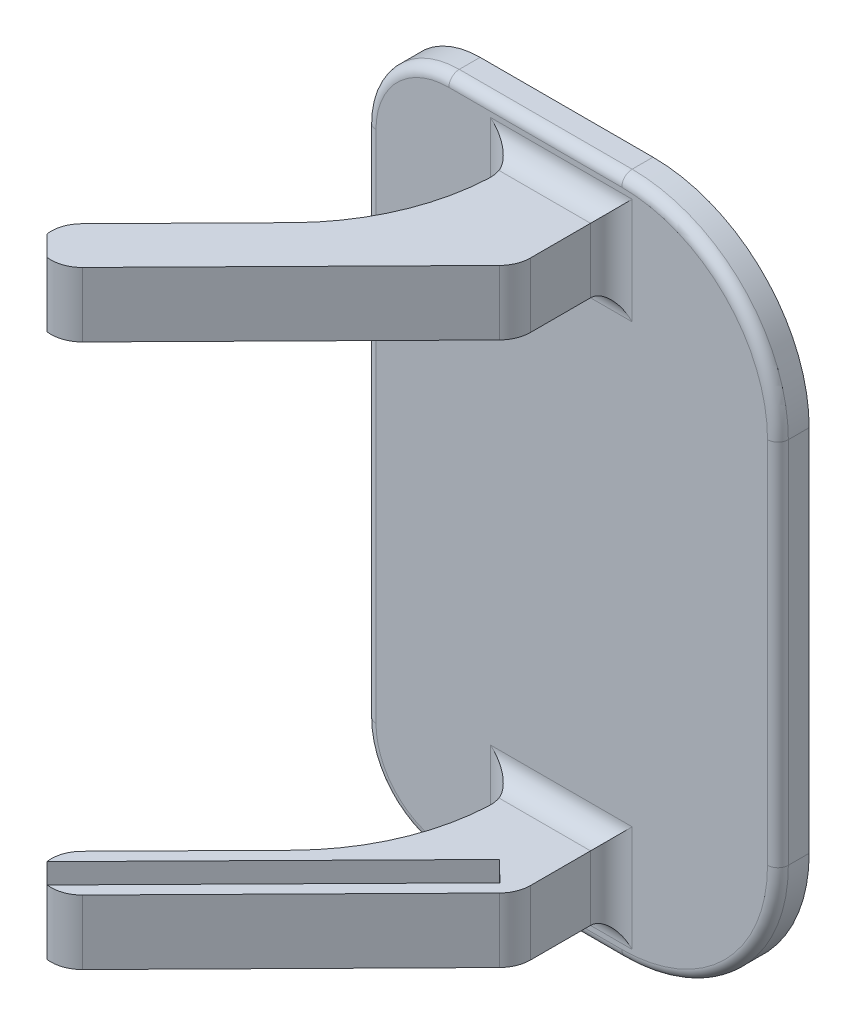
ISO-10303-21;
HEADER;
FILE_DESCRIPTION(('STEP AP214'),'2;1');
FILE_NAME('part.step','',(''),(''),'','','');
FILE_SCHEMA(('AUTOMOTIVE_DESIGN { 1 0 10303 214 1 1 1 1 }'));
ENDSEC;
DATA;
#1=APPLICATION_CONTEXT('core data for automotive mechanical design processes');
#2=APPLICATION_PROTOCOL_DEFINITION('international standard','automotive_design',2000,#1);
#3=PRODUCT_CONTEXT('',#1,'mechanical');
#4=PRODUCT('Part','Part','',(#3));
#5=PRODUCT_RELATED_PRODUCT_CATEGORY('part','',(#4));
#6=PRODUCT_DEFINITION_FORMATION('','',#4);
#7=PRODUCT_DEFINITION_CONTEXT('part definition',#1,'design');
#8=PRODUCT_DEFINITION('design','',#6,#7);
#9=PRODUCT_DEFINITION_SHAPE('','',#8);
#10=(LENGTH_UNIT() NAMED_UNIT(*) SI_UNIT(.MILLI.,.METRE.));
#11=(NAMED_UNIT(*) PLANE_ANGLE_UNIT() SI_UNIT($,.RADIAN.));
#12=(NAMED_UNIT(*) SI_UNIT($,.STERADIAN.) SOLID_ANGLE_UNIT());
#13=UNCERTAINTY_MEASURE_WITH_UNIT(LENGTH_MEASURE(1.E-05),#10,'distance_accuracy_value','');
#14=(GEOMETRIC_REPRESENTATION_CONTEXT(3) GLOBAL_UNCERTAINTY_ASSIGNED_CONTEXT((#13)) GLOBAL_UNIT_ASSIGNED_CONTEXT((#10,
#11,#12)) REPRESENTATION_CONTEXT('',''));
#15=CARTESIAN_POINT('',(0.,0.,0.));
#16=DIRECTION('',(0.,0.,1.));
#17=DIRECTION('',(1.,0.,0.));
#18=AXIS2_PLACEMENT_3D('',#15,#16,#17);
#19=CARTESIAN_POINT('',(0.,0.,-3.1429352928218));
#20=DIRECTION('',(0.,0.,-1.));
#21=DIRECTION('',(-1.,0.,0.));
#22=AXIS2_PLACEMENT_3D('',#19,#20,#21);
#23=PLANE('',#22);
#24=DIRECTION('',(0.,-1.,0.));
#25=VECTOR('',#24,1.);
#26=CARTESIAN_POINT('',(72.9423103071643,0.,-3.14293529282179));
#27=LINE('',#26,#25);
#28=CARTESIAN_POINT('',(72.9423103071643,13.5784093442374,-3.14293529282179));
#29=VERTEX_POINT('',#28);
#30=CARTESIAN_POINT('',(72.9423103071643,48.9784093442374,-3.14293529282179));
#31=VERTEX_POINT('',#30);
#32=EDGE_CURVE('E617',#29,#31,#27,.F.);
#33=ORIENTED_EDGE('',*,*,#32,.T.);
#34=CARTESIAN_POINT('',(58.9423103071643,48.9784093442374,-3.14293529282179));
#35=DIRECTION('',(0.,0.,-1.));
#36=DIRECTION('',(-1.,0.,0.));
#37=AXIS2_PLACEMENT_3D('',#34,#35,#36);
#38=CIRCLE('',#37,14.);
#39=CARTESIAN_POINT('',(58.9423103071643,62.9784093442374,-3.14293529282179));
#40=VERTEX_POINT('',#39);
#41=EDGE_CURVE('E823',#31,#40,#38,.F.);
#42=ORIENTED_EDGE('',*,*,#41,.T.);
#43=DIRECTION('',(1.,0.,0.));
#44=VECTOR('',#43,1.);
#45=CARTESIAN_POINT('',(0.,62.9784093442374,-3.1429352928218));
#46=LINE('',#45,#44);
#47=CARTESIAN_POINT('',(42.3371680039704,62.9784093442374,-3.14293529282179));
#48=VERTEX_POINT('',#47);
#49=EDGE_CURVE('E821',#40,#48,#46,.F.);
#50=ORIENTED_EDGE('',*,*,#49,.T.);
#51=CARTESIAN_POINT('',(42.3371680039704,55.9784093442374,-3.14293529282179));
#52=DIRECTION('',(0.,0.,-1.));
#53=DIRECTION('',(-1.,0.,0.));
#54=AXIS2_PLACEMENT_3D('',#51,#52,#53);
#55=CIRCLE('',#54,7.);
#56=CARTESIAN_POINT('',(35.3371680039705,55.9784093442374,-3.14293529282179));
#57=VERTEX_POINT('',#56);
#58=EDGE_CURVE('E819',#48,#57,#55,.F.);
#59=ORIENTED_EDGE('',*,*,#58,.T.);
#60=DIRECTION('',(0.,1.,0.));
#61=VECTOR('',#60,1.);
#62=CARTESIAN_POINT('',(35.3371680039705,0.,-3.14293529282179));
#63=LINE('',#62,#61);
#64=CARTESIAN_POINT('',(35.3371680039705,6.57840934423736,-3.14293529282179));
#65=VERTEX_POINT('',#64);
#66=EDGE_CURVE('E766',#57,#65,#63,.F.);
#67=ORIENTED_EDGE('',*,*,#66,.T.);
#68=CARTESIAN_POINT('',(42.3371680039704,6.57840934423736,-3.14293529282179));
#69=DIRECTION('',(0.,0.,-1.));
#70=DIRECTION('',(-1.,0.,0.));
#71=AXIS2_PLACEMENT_3D('',#68,#69,#70);
#72=CIRCLE('',#71,7.);
#73=CARTESIAN_POINT('',(42.3371680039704,-0.421590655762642,-3.14293529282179));
#74=VERTEX_POINT('',#73);
#75=EDGE_CURVE('E816',#65,#74,#72,.F.);
#76=ORIENTED_EDGE('',*,*,#75,.T.);
#77=DIRECTION('',(-1.,0.,0.));
#78=VECTOR('',#77,1.);
#79=CARTESIAN_POINT('',(0.,-0.421590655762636,-3.1429352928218));
#80=LINE('',#79,#78);
#81=CARTESIAN_POINT('',(58.9423103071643,-0.421590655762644,-3.14293529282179));
#82=VERTEX_POINT('',#81);
#83=EDGE_CURVE('E814',#74,#82,#80,.F.);
#84=ORIENTED_EDGE('',*,*,#83,.T.);
#85=CARTESIAN_POINT('',(58.9423103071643,13.5784093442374,-3.14293529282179));
#86=DIRECTION('',(0.,0.,-1.));
#87=DIRECTION('',(-1.,0.,0.));
#88=AXIS2_PLACEMENT_3D('',#85,#86,#87);
#89=CIRCLE('',#88,14.);
#90=EDGE_CURVE('E812',#82,#29,#89,.F.);
#91=ORIENTED_EDGE('',*,*,#90,.T.);
#92=EDGE_LOOP('',(#33,#42,#50,#59,#67,#76,#84,#91));
#93=FACE_BOUND('',#92,.T.);
#94=DIRECTION('',(0.,1.,0.));
#95=VECTOR('',#94,1.);
#96=CARTESIAN_POINT('',(46.3191986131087,8.27840934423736,-3.14293529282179));
#97=LINE('',#96,#95);
#98=CARTESIAN_POINT('',(46.3191986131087,0.0784093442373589,-3.14293529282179));
#99=VERTEX_POINT('',#98);
#100=CARTESIAN_POINT('',(46.3191986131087,10.2784093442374,-3.14293529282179));
#101=VERTEX_POINT('',#100);
#102=EDGE_CURVE('E530',#99,#101,#97,.T.);
#103=ORIENTED_EDGE('',*,*,#102,.T.);
#104=DIRECTION('',(1.,0.,0.));
#105=VECTOR('',#104,1.);
#106=CARTESIAN_POINT('',(57.9423103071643,10.2784093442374,-3.14293529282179));
#107=LINE('',#106,#105);
#108=CARTESIAN_POINT('',(59.9423103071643,10.2784093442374,-3.14293529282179));
#109=VERTEX_POINT('',#108);
#110=EDGE_CURVE('E552',#101,#109,#107,.T.);
#111=ORIENTED_EDGE('',*,*,#110,.T.);
#112=DIRECTION('',(0.,1.,0.));
#113=VECTOR('',#112,1.);
#114=CARTESIAN_POINT('',(59.9423103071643,2.07840934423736,-3.14293529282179));
#115=LINE('',#114,#113);
#116=CARTESIAN_POINT('',(59.9423103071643,0.0784093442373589,-3.14293529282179));
#117=VERTEX_POINT('',#116);
#118=EDGE_CURVE('E550',#109,#117,#115,.F.);
#119=ORIENTED_EDGE('',*,*,#118,.T.);
#120=DIRECTION('',(1.,0.,0.));
#121=VECTOR('',#120,1.);
#122=CARTESIAN_POINT('',(0.,0.0784093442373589,-3.1429352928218));
#123=LINE('',#122,#121);
#124=EDGE_CURVE('E547',#117,#99,#123,.F.);
#125=ORIENTED_EDGE('',*,*,#124,.T.);
#126=EDGE_LOOP('',(#103,#111,#119,#125));
#127=FACE_BOUND('',#126,.T.);
#128=DIRECTION('',(-1.,0.,0.));
#129=VECTOR('',#128,1.);
#130=CARTESIAN_POINT('',(46.3191986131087,52.2784093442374,-3.14293529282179));
#131=LINE('',#130,#129);
#132=CARTESIAN_POINT('',(59.9423103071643,52.2784093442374,-3.14293529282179));
#133=VERTEX_POINT('',#132);
#134=CARTESIAN_POINT('',(46.3191986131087,52.2784093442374,-3.14293529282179));
#135=VERTEX_POINT('',#134);
#136=EDGE_CURVE('E559',#133,#135,#131,.T.);
#137=ORIENTED_EDGE('',*,*,#136,.T.);
#138=DIRECTION('',(0.,1.,0.));
#139=VECTOR('',#138,1.);
#140=CARTESIAN_POINT('',(46.3191986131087,0.,-3.14293529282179));
#141=LINE('',#140,#139);
#142=CARTESIAN_POINT('',(46.3191986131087,62.4784093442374,-3.14293529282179));
#143=VERTEX_POINT('',#142);
#144=EDGE_CURVE('E532',#135,#143,#141,.T.);
#145=ORIENTED_EDGE('',*,*,#144,.T.);
#146=DIRECTION('',(-1.,0.,0.));
#147=VECTOR('',#146,1.);
#148=CARTESIAN_POINT('',(0.,62.4784093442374,-3.1429352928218));
#149=LINE('',#148,#147);
#150=CARTESIAN_POINT('',(59.9423103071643,62.4784093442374,-3.14293529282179));
#151=VERTEX_POINT('',#150);
#152=EDGE_CURVE('E557',#143,#151,#149,.F.);
#153=ORIENTED_EDGE('',*,*,#152,.T.);
#154=DIRECTION('',(0.,1.,0.));
#155=VECTOR('',#154,1.);
#156=CARTESIAN_POINT('',(59.9423103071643,0.,-3.14293529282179));
#157=LINE('',#156,#155);
#158=EDGE_CURVE('E555',#151,#133,#157,.F.);
#159=ORIENTED_EDGE('',*,*,#158,.T.);
#160=EDGE_LOOP('',(#137,#145,#153,#159));
#161=FACE_BOUND('',#160,.T.);
#162=ADVANCED_FACE('F33',(#93,#127,#161),#23,.F.);
#163=CARTESIAN_POINT('',(34.6894237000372,3.27840934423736,27.7896267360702));
#164=DIRECTION('',(0.713053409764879,0.,0.701109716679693));
#165=DIRECTION('',(0.701109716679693,0.,-0.713053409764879));
#166=AXIS2_PLACEMENT_3D('',#163,#164,#165);
#167=PLANE('',#166);
#168=DIRECTION('',(0.,1.,0.));
#169=VECTOR('',#168,1.);
#170=CARTESIAN_POINT('',(34.6894237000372,3.27840934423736,27.7896267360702));
#171=LINE('',#170,#169);
#172=CARTESIAN_POINT('',(34.6894237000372,3.27840934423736,27.7896267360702));
#173=VERTEX_POINT('',#172);
#174=CARTESIAN_POINT('',(34.6894237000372,8.27840934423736,27.7896267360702));
#175=VERTEX_POINT('',#174);
#176=EDGE_CURVE('E476',#173,#175,#171,.T.);
#177=ORIENTED_EDGE('',*,*,#176,.T.);
#178=DIRECTION('',(0.701109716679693,0.,-0.713053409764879));
#179=VECTOR('',#178,1.);
#180=CARTESIAN_POINT('',(34.6894237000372,8.27840934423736,27.7896267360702));
#181=LINE('',#180,#179);
#182=CARTESIAN_POINT('',(56.2453145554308,8.27840934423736,5.86652239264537));
#183=VERTEX_POINT('',#182);
#184=EDGE_CURVE('E443',#175,#183,#181,.T.);
#185=ORIENTED_EDGE('',*,*,#184,.T.);
#186=DIRECTION('',(0.,1.,0.));
#187=VECTOR('',#186,1.);
#188=CARTESIAN_POINT('',(56.2453145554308,3.27840934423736,5.86652239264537));
#189=LINE('',#188,#187);
#190=CARTESIAN_POINT('',(56.2453145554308,3.27840934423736,5.86652239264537));
#191=VERTEX_POINT('',#190);
#192=EDGE_CURVE('E474',#191,#183,#189,.T.);
#193=ORIENTED_EDGE('',*,*,#192,.F.);
#194=DIRECTION('',(0.701109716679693,0.,-0.713053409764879));
#195=VECTOR('',#194,1.);
#196=CARTESIAN_POINT('',(34.6894237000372,3.27840934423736,27.7896267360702));
#197=LINE('',#196,#195);
#198=EDGE_CURVE('E460',#173,#191,#197,.T.);
#199=ORIENTED_EDGE('',*,*,#198,.F.);
#200=EDGE_LOOP('',(#177,#185,#193,#199));
#201=FACE_BOUND('',#200,.T.);
#202=ADVANCED_FACE('F660',(#201),#167,.F.);
#203=CARTESIAN_POINT('',(56.2453145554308,3.27840934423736,5.86652239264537));
#204=DIRECTION('',(0.701109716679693,0.,-0.71305340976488));
#205=DIRECTION('',(-0.71305340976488,0.,-0.701109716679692));
#206=AXIS2_PLACEMENT_3D('',#203,#204,#205);
#207=PLANE('',#206);
#208=ORIENTED_EDGE('',*,*,#192,.T.);
#209=DIRECTION('',(-0.71305340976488,0.,-0.701109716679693));
#210=VECTOR('',#209,1.);
#211=CARTESIAN_POINT('',(56.2453145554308,8.27840934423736,5.86652239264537));
#212=LINE('',#211,#210);
#213=CARTESIAN_POINT('',(54.2857692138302,8.27840934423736,3.93979956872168));
#214=VERTEX_POINT('',#213);
#215=EDGE_CURVE('E446',#183,#214,#212,.T.);
#216=ORIENTED_EDGE('',*,*,#215,.T.);
#217=DIRECTION('',(0.,1.,0.));
#218=VECTOR('',#217,1.);
#219=CARTESIAN_POINT('',(54.2857692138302,3.27840934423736,3.93979956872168));
#220=LINE('',#219,#218);
#221=CARTESIAN_POINT('',(54.2857692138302,3.27840934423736,3.93979956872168));
#222=VERTEX_POINT('',#221);
#223=EDGE_CURVE('E472',#222,#214,#220,.T.);
#224=ORIENTED_EDGE('',*,*,#223,.F.);
#225=DIRECTION('',(-0.71305340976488,0.,-0.701109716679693));
#226=VECTOR('',#225,1.);
#227=CARTESIAN_POINT('',(56.2453145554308,3.27840934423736,5.86652239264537));
#228=LINE('',#227,#226);
#229=EDGE_CURVE('E463',#191,#222,#228,.T.);
#230=ORIENTED_EDGE('',*,*,#229,.F.);
#231=EDGE_LOOP('',(#208,#216,#224,#230));
#232=FACE_BOUND('',#231,.T.);
#233=ADVANCED_FACE('F666',(#232),#207,.F.);
#234=CARTESIAN_POINT('',(54.2857692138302,3.27840934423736,3.93979956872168));
#235=DIRECTION('',(-0.713053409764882,0.,-0.70110971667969));
#236=DIRECTION('',(-0.70110971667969,0.,0.713053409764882));
#237=AXIS2_PLACEMENT_3D('',#234,#235,#236);
#238=PLANE('',#237);
#239=ORIENTED_EDGE('',*,*,#223,.T.);
#240=DIRECTION('',(-0.70110971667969,0.,0.713053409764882));
#241=VECTOR('',#240,1.);
#242=CARTESIAN_POINT('',(54.2857692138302,8.27840934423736,3.93979956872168));
#243=LINE('',#242,#241);
#244=CARTESIAN_POINT('',(32.7298783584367,8.27840934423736,25.8629039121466));
#245=VERTEX_POINT('',#244);
#246=EDGE_CURVE('E449',#214,#245,#243,.T.);
#247=ORIENTED_EDGE('',*,*,#246,.T.);
#248=DIRECTION('',(0.,1.,0.));
#249=VECTOR('',#248,1.);
#250=CARTESIAN_POINT('',(32.7298783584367,3.27840934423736,25.8629039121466));
#251=LINE('',#250,#249);
#252=CARTESIAN_POINT('',(32.7298783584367,3.27840934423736,25.8629039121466));
#253=VERTEX_POINT('',#252);
#254=EDGE_CURVE('E469',#253,#245,#251,.T.);
#255=ORIENTED_EDGE('',*,*,#254,.F.);
#256=DIRECTION('',(-0.70110971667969,0.,0.713053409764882));
#257=VECTOR('',#256,1.);
#258=CARTESIAN_POINT('',(54.2857692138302,3.27840934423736,3.93979956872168));
#259=LINE('',#258,#257);
#260=EDGE_CURVE('E466',#222,#253,#259,.T.);
#261=ORIENTED_EDGE('',*,*,#260,.F.);
#262=EDGE_LOOP('',(#239,#247,#255,#261));
#263=FACE_BOUND('',#262,.T.);
#264=ADVANCED_FACE('F719',(#263),#238,.F.);
#265=CARTESIAN_POINT('',(49.3371680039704,3.27840934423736,7.26112989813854));
#266=DIRECTION('',(0.713053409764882,0.,0.701109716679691));
#267=DIRECTION('',(0.701109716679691,0.,-0.713053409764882));
#268=AXIS2_PLACEMENT_3D('',#265,#266,#267);
#269=PLANE('',#268);
#270=DIRECTION('',(0.70110971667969,0.,-0.713053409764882));
#271=VECTOR('',#270,1.);
#272=CARTESIAN_POINT('',(49.3371680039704,8.27840934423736,7.26112989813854));
#273=LINE('',#272,#271);
#274=CARTESIAN_POINT('',(33.5568775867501,8.27840934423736,23.3102440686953));
#275=VERTEX_POINT('',#274);
#276=CARTESIAN_POINT('',(43.5982361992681,8.27840934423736,13.0978267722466));
#277=VERTEX_POINT('',#276);
#278=EDGE_CURVE('E452',#275,#277,#273,.T.);
#279=ORIENTED_EDGE('',*,*,#278,.T.);
#280=DIRECTION('',(0.,1.,0.));
#281=VECTOR('',#280,1.);
#282=CARTESIAN_POINT('',(43.5982361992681,2.07840934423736,13.0978267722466));
#283=LINE('',#282,#281);
#284=CARTESIAN_POINT('',(43.5982361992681,2.07840934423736,13.0978267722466));
#285=VERTEX_POINT('',#284);
#286=EDGE_CURVE('E497',#277,#285,#283,.F.);
#287=ORIENTED_EDGE('',*,*,#286,.T.);
#288=DIRECTION('',(0.701109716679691,0.,-0.713053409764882));
#289=VECTOR('',#288,1.);
#290=CARTESIAN_POINT('',(33.5568775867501,2.07840934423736,23.3102440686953));
#291=LINE('',#290,#289);
#292=CARTESIAN_POINT('',(33.5568775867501,2.07840934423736,23.3102440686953));
#293=VERTEX_POINT('',#292);
#294=EDGE_CURVE('E420',#293,#285,#291,.T.);
#295=ORIENTED_EDGE('',*,*,#294,.F.);
#296=DIRECTION('',(0.,1.,0.));
#297=VECTOR('',#296,1.);
#298=CARTESIAN_POINT('',(33.5568775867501,3.27840934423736,23.3102440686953));
#299=LINE('',#298,#297);
#300=EDGE_CURVE('E479',#293,#275,#299,.T.);
#301=ORIENTED_EDGE('',*,*,#300,.T.);
#302=EDGE_LOOP('',(#279,#287,#295,#301));
#303=FACE_BOUND('',#302,.T.);
#304=ADVANCED_FACE('F715',(#303),#269,.F.);
#305=CARTESIAN_POINT('',(57.9423103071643,3.27840934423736,-3.14293529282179));
#306=DIRECTION('',(-1.,0.,0.));
#307=DIRECTION('',(0.,0.,1.));
#308=AXIS2_PLACEMENT_3D('',#305,#306,#307);
#309=PLANE('',#308);
#310=DIRECTION('',(0.,0.,1.));
#311=VECTOR('',#310,1.);
#312=CARTESIAN_POINT('',(57.9423103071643,2.07840934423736,-3.14293529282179));
#313=LINE('',#312,#311);
#314=CARTESIAN_POINT('',(57.9423103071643,2.07840934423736,-1.14293529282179));
#315=VERTEX_POINT('',#314);
#316=CARTESIAN_POINT('',(57.9423103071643,2.07840934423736,4.62436534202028));
#317=VERTEX_POINT('',#316);
#318=EDGE_CURVE('E423',#315,#317,#313,.T.);
#319=ORIENTED_EDGE('',*,*,#318,.F.);
#320=DIRECTION('',(0.,1.,0.));
#321=VECTOR('',#320,1.);
#322=CARTESIAN_POINT('',(57.9423103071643,8.27840934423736,-1.14293529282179));
#323=LINE('',#322,#321);
#324=CARTESIAN_POINT('',(57.9423103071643,8.27840934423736,-1.14293529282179));
#325=VERTEX_POINT('',#324);
#326=EDGE_CURVE('E570',#315,#325,#323,.T.);
#327=ORIENTED_EDGE('',*,*,#326,.T.);
#328=DIRECTION('',(0.,0.,1.));
#329=VECTOR('',#328,1.);
#330=CARTESIAN_POINT('',(57.9423103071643,8.27840934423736,-3.14293529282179));
#331=LINE('',#330,#329);
#332=CARTESIAN_POINT('',(57.9423103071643,8.27840934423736,4.62436534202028));
#333=VERTEX_POINT('',#332);
#334=EDGE_CURVE('E455',#325,#333,#331,.T.);
#335=ORIENTED_EDGE('',*,*,#334,.T.);
#336=DIRECTION('',(0.,1.,0.));
#337=VECTOR('',#336,1.);
#338=CARTESIAN_POINT('',(57.9423103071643,3.27840934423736,4.62436534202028));
#339=LINE('',#338,#337);
#340=EDGE_CURVE('E494',#333,#317,#339,.F.);
#341=ORIENTED_EDGE('',*,*,#340,.T.);
#342=EDGE_LOOP('',(#319,#327,#335,#341));
#343=FACE_BOUND('',#342,.T.);
#344=ADVANCED_FACE('F711',(#343),#309,.F.);
#345=CARTESIAN_POINT('',(35.5450877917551,3.27840934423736,28.6309583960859));
#346=DIRECTION('',(-0.713053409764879,0.,-0.701109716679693));
#347=DIRECTION('',(-0.701109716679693,0.,0.713053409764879));
#348=AXIS2_PLACEMENT_3D('',#345,#346,#347);
#349=PLANE('',#348);
#350=DIRECTION('',(-0.701109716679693,0.,0.713053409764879));
#351=VECTOR('',#350,1.);
#352=CARTESIAN_POINT('',(35.5450877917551,8.27840934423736,28.6309583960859));
#353=LINE('',#352,#351);
#354=CARTESIAN_POINT('',(57.0814705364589,8.27840934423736,6.72769449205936));
#355=VERTEX_POINT('',#354);
#356=CARTESIAN_POINT('',(37.2277511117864,8.27840934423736,26.9196302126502));
#357=VERTEX_POINT('',#356);
#358=EDGE_CURVE('E457',#355,#357,#353,.T.);
#359=ORIENTED_EDGE('',*,*,#358,.T.);
#360=DIRECTION('',(0.,-1.,0.));
#361=VECTOR('',#360,1.);
#362=CARTESIAN_POINT('',(37.2277511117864,3.27840934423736,26.9196302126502));
#363=LINE('',#362,#361);
#364=CARTESIAN_POINT('',(37.2277511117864,2.07840934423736,26.9196302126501));
#365=VERTEX_POINT('',#364);
#366=EDGE_CURVE('E492',#357,#365,#363,.T.);
#367=ORIENTED_EDGE('',*,*,#366,.T.);
#368=DIRECTION('',(-0.701109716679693,0.,0.713053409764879));
#369=VECTOR('',#368,1.);
#370=CARTESIAN_POINT('',(57.0814705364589,2.07840934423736,6.72769449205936));
#371=LINE('',#370,#369);
#372=CARTESIAN_POINT('',(57.0814705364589,2.07840934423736,6.72769449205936));
#373=VERTEX_POINT('',#372);
#374=EDGE_CURVE('E428',#373,#365,#371,.T.);
#375=ORIENTED_EDGE('',*,*,#374,.F.);
#376=DIRECTION('',(0.,1.,0.));
#377=VECTOR('',#376,1.);
#378=CARTESIAN_POINT('',(57.0814705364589,3.27840934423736,6.72769449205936));
#379=LINE('',#378,#377);
#380=EDGE_CURVE('E489',#373,#355,#379,.T.);
#381=ORIENTED_EDGE('',*,*,#380,.T.);
#382=EDGE_LOOP('',(#359,#367,#375,#381));
#383=FACE_BOUND('',#382,.T.);
#384=ADVANCED_FACE('F707',(#383),#349,.F.);
#385=CARTESIAN_POINT('',(0.,8.27840934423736,0.));
#386=DIRECTION('',(0.,-1.,0.));
#387=DIRECTION('',(0.,0.,-1.));
#388=AXIS2_PLACEMENT_3D('',#385,#386,#387);
#389=PLANE('',#388);
#390=ORIENTED_EDGE('',*,*,#334,.F.);
#391=DIRECTION('',(1.,0.,0.));
#392=VECTOR('',#391,1.);
#393=CARTESIAN_POINT('',(46.3191986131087,8.27840934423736,-1.14293529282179));
#394=LINE('',#393,#392);
#395=CARTESIAN_POINT('',(49.1476257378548,8.27840934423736,-1.14293529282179));
#396=VERTEX_POINT('',#395);
#397=EDGE_CURVE('E568',#325,#396,#394,.F.);
#398=ORIENTED_EDGE('',*,*,#397,.T.);
#399=CARTESIAN_POINT('',(46.3191986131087,8.27840934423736,-0.142935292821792));
#400=DIRECTION('',(0.,-1.,0.));
#401=DIRECTION('',(0.,0.,-1.));
#402=AXIS2_PLACEMENT_3D('',#399,#400,#401);
#403=CIRCLE('',#402,3.);
#404=CARTESIAN_POINT('',(49.316027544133,8.27840934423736,-0.00503548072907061));
#405=VERTEX_POINT('',#404);
#406=EDGE_CURVE('E542',#396,#405,#403,.T.);
#407=ORIENTED_EDGE('',*,*,#406,.T.);
#408=CARTESIAN_POINT('',(29.3371680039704,8.27840934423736,-0.924367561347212));
#409=DIRECTION('',(0.,-1.,0.));
#410=DIRECTION('',(0.,0.,-1.));
#411=AXIS2_PLACEMENT_3D('',#408,#409,#410);
#412=CIRCLE('',#411,20.);
#413=EDGE_CURVE('E499',#405,#277,#412,.T.);
#414=ORIENTED_EDGE('',*,*,#413,.T.);
#415=ORIENTED_EDGE('',*,*,#278,.F.);
#416=CARTESIAN_POINT('',(35.6960378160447,8.27840934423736,25.4135732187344));
#417=DIRECTION('',(0.,-1.,0.));
#418=DIRECTION('',(0.,0.,-1.));
#419=AXIS2_PLACEMENT_3D('',#416,#417,#418);
#420=CIRCLE('',#419,3.);
#421=EDGE_CURVE('E487',#275,#245,#420,.F.);
#422=ORIENTED_EDGE('',*,*,#421,.T.);
#423=ORIENTED_EDGE('',*,*,#246,.F.);
#424=ORIENTED_EDGE('',*,*,#215,.F.);
#425=ORIENTED_EDGE('',*,*,#184,.F.);
#426=CARTESIAN_POINT('',(35.0885908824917,8.27840934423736,24.8163010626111));
#427=DIRECTION('',(0.,-1.,0.));
#428=DIRECTION('',(0.,0.,-1.));
#429=AXIS2_PLACEMENT_3D('',#426,#427,#428);
#430=CIRCLE('',#429,3.);
#431=EDGE_CURVE('E485',#175,#357,#430,.F.);
#432=ORIENTED_EDGE('',*,*,#431,.T.);
#433=ORIENTED_EDGE('',*,*,#358,.F.);
#434=CARTESIAN_POINT('',(54.9423103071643,8.27840934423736,4.62436534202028));
#435=DIRECTION('',(0.,-1.,0.));
#436=DIRECTION('',(0.,0.,-1.));
#437=AXIS2_PLACEMENT_3D('',#434,#435,#436);
#438=CIRCLE('',#437,3.);
#439=EDGE_CURVE('E482',#355,#333,#438,.F.);
#440=ORIENTED_EDGE('',*,*,#439,.T.);
#441=EDGE_LOOP('',(#390,#398,#407,#414,#415,#422,#423,#424,#425,#432,#433,#440));
#442=FACE_BOUND('',#441,.T.);
#443=ADVANCED_FACE('F703',(#442),#389,.F.);
#444=CARTESIAN_POINT('',(35.6960378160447,3.27840934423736,25.4135732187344));
#445=DIRECTION('',(0.,1.,0.));
#446=DIRECTION('',(0.,0.,1.));
#447=AXIS2_PLACEMENT_3D('',#444,#445,#446);
#448=CYLINDRICAL_SURFACE('',#447,3.);
#449=ORIENTED_EDGE('',*,*,#300,.F.);
#450=CARTESIAN_POINT('',(35.6960378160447,2.07840934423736,25.4135732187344));
#451=DIRECTION('',(0.,-1.,0.));
#452=DIRECTION('',(0.,0.,-1.));
#453=AXIS2_PLACEMENT_3D('',#450,#451,#452);
#454=CIRCLE('',#453,3.);
#455=CARTESIAN_POINT('',(32.7298783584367,2.07840934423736,25.8629039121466));
#456=VERTEX_POINT('',#455);
#457=EDGE_CURVE('E417',#456,#293,#454,.T.);
#458=ORIENTED_EDGE('',*,*,#457,.F.);
#459=DIRECTION('',(0.,1.,0.));
#460=VECTOR('',#459,1.);
#461=CARTESIAN_POINT('',(32.7298783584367,2.07840934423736,25.8629039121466));
#462=LINE('',#461,#460);
#463=EDGE_CURVE('E435',#456,#253,#462,.T.);
#464=ORIENTED_EDGE('',*,*,#463,.T.);
#465=ORIENTED_EDGE('',*,*,#254,.T.);
#466=ORIENTED_EDGE('',*,*,#421,.F.);
#467=EDGE_LOOP('',(#449,#458,#464,#465,#466));
#468=FACE_BOUND('',#467,.T.);
#469=ADVANCED_FACE('F706',(#468),#448,.T.);
#470=CARTESIAN_POINT('',(35.0885908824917,3.27840934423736,24.8163010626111));
#471=DIRECTION('',(0.,-1.,0.));
#472=DIRECTION('',(0.,0.,-1.));
#473=AXIS2_PLACEMENT_3D('',#470,#471,#472);
#474=CYLINDRICAL_SURFACE('',#473,3.);
#475=ORIENTED_EDGE('',*,*,#176,.F.);
#476=DIRECTION('',(0.,1.,0.));
#477=VECTOR('',#476,1.);
#478=CARTESIAN_POINT('',(34.6894237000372,2.07840934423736,27.7896267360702));
#479=LINE('',#478,#477);
#480=CARTESIAN_POINT('',(34.6894237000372,2.07840934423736,27.7896267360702));
#481=VERTEX_POINT('',#480);
#482=EDGE_CURVE('E440',#481,#173,#479,.T.);
#483=ORIENTED_EDGE('',*,*,#482,.F.);
#484=CARTESIAN_POINT('',(35.0885908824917,2.07840934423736,24.8163010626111));
#485=DIRECTION('',(0.,-1.,0.));
#486=DIRECTION('',(0.,0.,-1.));
#487=AXIS2_PLACEMENT_3D('',#484,#485,#486);
#488=CIRCLE('',#487,3.);
#489=EDGE_CURVE('E431',#365,#481,#488,.T.);
#490=ORIENTED_EDGE('',*,*,#489,.F.);
#491=ORIENTED_EDGE('',*,*,#366,.F.);
#492=ORIENTED_EDGE('',*,*,#431,.F.);
#493=EDGE_LOOP('',(#475,#483,#490,#491,#492));
#494=FACE_BOUND('',#493,.T.);
#495=ADVANCED_FACE('F729',(#494),#474,.T.);
#496=CARTESIAN_POINT('',(54.9423103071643,3.27840934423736,4.62436534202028));
#497=DIRECTION('',(0.,1.,0.));
#498=DIRECTION('',(0.,0.,1.));
#499=AXIS2_PLACEMENT_3D('',#496,#497,#498);
#500=CYLINDRICAL_SURFACE('',#499,3.);
#501=ORIENTED_EDGE('',*,*,#380,.F.);
#502=CARTESIAN_POINT('',(54.9423103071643,2.07840934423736,4.62436534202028));
#503=DIRECTION('',(0.,-1.,0.));
#504=DIRECTION('',(0.,0.,-1.));
#505=AXIS2_PLACEMENT_3D('',#502,#503,#504);
#506=CIRCLE('',#505,3.);
#507=EDGE_CURVE('E425',#317,#373,#506,.T.);
#508=ORIENTED_EDGE('',*,*,#507,.F.);
#509=ORIENTED_EDGE('',*,*,#340,.F.);
#510=ORIENTED_EDGE('',*,*,#439,.F.);
#511=EDGE_LOOP('',(#501,#508,#509,#510));
#512=FACE_BOUND('',#511,.T.);
#513=ADVANCED_FACE('F698',(#512),#500,.T.);
#514=CARTESIAN_POINT('',(35.6960378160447,3.27840934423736,25.4135732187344));
#515=DIRECTION('',(0.,-1.,0.));
#516=DIRECTION('',(0.,0.,-1.));
#517=AXIS2_PLACEMENT_3D('',#514,#515,#516);
#518=PLANE('',#517);
#519=ORIENTED_EDGE('',*,*,#229,.T.);
#520=ORIENTED_EDGE('',*,*,#260,.T.);
#521=DIRECTION('',(-0.71305340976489,0.,-0.701109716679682));
#522=VECTOR('',#521,1.);
#523=CARTESIAN_POINT('',(32.7298783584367,3.27840934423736,25.8629039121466));
#524=LINE('',#523,#522);
#525=EDGE_CURVE('E416',#173,#253,#524,.T.);
#526=ORIENTED_EDGE('',*,*,#525,.F.);
#527=ORIENTED_EDGE('',*,*,#198,.T.);
#528=EDGE_LOOP('',(#519,#520,#526,#527));
#529=FACE_BOUND('',#528,.T.);
#530=ADVANCED_FACE('F695',(#529),#518,.F.);
#531=CARTESIAN_POINT('',(32.7298783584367,2.07840934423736,25.8629039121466));
#532=DIRECTION('',(0.701109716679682,0.,-0.71305340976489));
#533=DIRECTION('',(-0.71305340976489,0.,-0.701109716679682));
#534=AXIS2_PLACEMENT_3D('',#531,#532,#533);
#535=PLANE('',#534);
#536=ORIENTED_EDGE('',*,*,#525,.T.);
#537=ORIENTED_EDGE('',*,*,#463,.F.);
#538=DIRECTION('',(-0.71305340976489,0.,-0.701109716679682));
#539=VECTOR('',#538,1.);
#540=CARTESIAN_POINT('',(32.7298783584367,2.07840934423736,25.8629039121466));
#541=LINE('',#540,#539);
#542=EDGE_CURVE('E433',#481,#456,#541,.T.);
#543=ORIENTED_EDGE('',*,*,#542,.F.);
#544=ORIENTED_EDGE('',*,*,#482,.T.);
#545=EDGE_LOOP('',(#536,#537,#543,#544));
#546=FACE_BOUND('',#545,.T.);
#547=ADVANCED_FACE('F693',(#546),#535,.F.);
#548=CARTESIAN_POINT('',(35.6960378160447,2.07840934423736,25.4135732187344));
#549=DIRECTION('',(0.,-1.,0.));
#550=DIRECTION('',(0.,0.,-1.));
#551=AXIS2_PLACEMENT_3D('',#548,#549,#550);
#552=PLANE('',#551);
#553=CARTESIAN_POINT('',(46.3191986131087,2.07840934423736,-0.142935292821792));
#554=DIRECTION('',(0.,-1.,0.));
#555=DIRECTION('',(0.,0.,-1.));
#556=AXIS2_PLACEMENT_3D('',#553,#554,#555);
#557=CIRCLE('',#556,3.);
#558=CARTESIAN_POINT('',(49.316027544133,2.07840934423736,-0.00503548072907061));
#559=VERTEX_POINT('',#558);
#560=CARTESIAN_POINT('',(49.1476257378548,2.07840934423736,-1.14293529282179));
#561=VERTEX_POINT('',#560);
#562=EDGE_CURVE('E544',#559,#561,#557,.F.);
#563=ORIENTED_EDGE('',*,*,#562,.T.);
#564=DIRECTION('',(1.,0.,0.));
#565=VECTOR('',#564,1.);
#566=CARTESIAN_POINT('',(35.6960378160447,2.07840934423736,-1.14293529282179));
#567=LINE('',#566,#565);
#568=EDGE_CURVE('E572',#561,#315,#567,.T.);
#569=ORIENTED_EDGE('',*,*,#568,.T.);
#570=ORIENTED_EDGE('',*,*,#318,.T.);
#571=ORIENTED_EDGE('',*,*,#507,.T.);
#572=ORIENTED_EDGE('',*,*,#374,.T.);
#573=ORIENTED_EDGE('',*,*,#489,.T.);
#574=ORIENTED_EDGE('',*,*,#542,.T.);
#575=ORIENTED_EDGE('',*,*,#457,.T.);
#576=ORIENTED_EDGE('',*,*,#294,.T.);
#577=CARTESIAN_POINT('',(29.3371680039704,2.07840934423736,-0.924367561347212));
#578=DIRECTION('',(0.,-1.,0.));
#579=DIRECTION('',(0.,0.,-1.));
#580=AXIS2_PLACEMENT_3D('',#577,#578,#579);
#581=CIRCLE('',#580,20.);
#582=EDGE_CURVE('E501',#285,#559,#581,.F.);
#583=ORIENTED_EDGE('',*,*,#582,.T.);
#584=EDGE_LOOP('',(#563,#569,#570,#571,#572,#573,#574,#575,#576,#583));
#585=FACE_BOUND('',#584,.T.);
#586=ADVANCED_FACE('F690',(#585),#552,.T.);
#587=CARTESIAN_POINT('',(29.3371680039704,3.27840934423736,-0.924367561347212));
#588=DIRECTION('',(0.,-1.,0.));
#589=DIRECTION('',(0.,0.,-1.));
#590=AXIS2_PLACEMENT_3D('',#587,#588,#589);
#591=CYLINDRICAL_SURFACE('',#590,20.);
#592=ORIENTED_EDGE('',*,*,#413,.F.);
#593=DIRECTION('',(0.,-1.,0.));
#594=VECTOR('',#593,1.);
#595=CARTESIAN_POINT('',(49.3160275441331,3.27840934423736,-0.0050354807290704));
#596=LINE('',#595,#594);
#597=EDGE_CURVE('E536',#405,#559,#596,.T.);
#598=ORIENTED_EDGE('',*,*,#597,.T.);
#599=ORIENTED_EDGE('',*,*,#582,.F.);
#600=ORIENTED_EDGE('',*,*,#286,.F.);
#601=EDGE_LOOP('',(#592,#598,#599,#600));
#602=FACE_BOUND('',#601,.T.);
#603=ADVANCED_FACE('F688',(#602),#591,.F.);
#604=CARTESIAN_POINT('',(34.3371680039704,-1.42159065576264,-6.14293529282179));
#605=DIRECTION('',(1.,0.,0.));
#606=DIRECTION('',(0.,0.,-1.));
#607=AXIS2_PLACEMENT_3D('',#604,#605,#606);
#608=PLANE('',#607);
#609=DIRECTION('',(0.,0.,1.));
#610=VECTOR('',#609,1.);
#611=CARTESIAN_POINT('',(34.3371680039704,6.57840934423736,-6.14293529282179));
#612=LINE('',#611,#610);
#613=CARTESIAN_POINT('',(34.3371680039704,6.57840934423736,-6.14293529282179));
#614=VERTEX_POINT('',#613);
#615=CARTESIAN_POINT('',(34.3371680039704,6.57840934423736,-4.14293529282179));
#616=VERTEX_POINT('',#615);
#617=EDGE_CURVE('E519',#614,#616,#612,.T.);
#618=ORIENTED_EDGE('',*,*,#617,.T.);
#619=DIRECTION('',(0.,1.,0.));
#620=VECTOR('',#619,1.);
#621=CARTESIAN_POINT('',(34.3371680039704,-1.42159065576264,-4.14293529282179));
#622=LINE('',#621,#620);
#623=CARTESIAN_POINT('',(34.3371680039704,55.9784093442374,-4.14293529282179));
#624=VERTEX_POINT('',#623);
#625=EDGE_CURVE('E765',#616,#624,#622,.T.);
#626=ORIENTED_EDGE('',*,*,#625,.T.);
#627=DIRECTION('',(0.,0.,1.));
#628=VECTOR('',#627,1.);
#629=CARTESIAN_POINT('',(34.3371680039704,55.9784093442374,-6.14293529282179));
#630=LINE('',#629,#628);
#631=CARTESIAN_POINT('',(34.3371680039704,55.9784093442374,-6.14293529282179));
#632=VERTEX_POINT('',#631);
#633=EDGE_CURVE('E522',#624,#632,#630,.F.);
#634=ORIENTED_EDGE('',*,*,#633,.T.);
#635=DIRECTION('',(0.,1.,0.));
#636=VECTOR('',#635,1.);
#637=CARTESIAN_POINT('',(34.3371680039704,-1.42159065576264,-6.14293529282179));
#638=LINE('',#637,#636);
#639=EDGE_CURVE('E391',#614,#632,#638,.T.);
#640=ORIENTED_EDGE('',*,*,#639,.F.);
#641=EDGE_LOOP('',(#618,#626,#634,#640));
#642=FACE_BOUND('',#641,.T.);
#643=ADVANCED_FACE('F684',(#642),#608,.F.);
#644=CARTESIAN_POINT('',(34.3371680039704,63.9784093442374,-6.14293529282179));
#645=DIRECTION('',(0.,-1.,0.));
#646=DIRECTION('',(0.,0.,-1.));
#647=AXIS2_PLACEMENT_3D('',#644,#645,#646);
#648=PLANE('',#647);
#649=DIRECTION('',(0.,0.,1.));
#650=VECTOR('',#649,1.);
#651=CARTESIAN_POINT('',(42.3371680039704,63.9784093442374,-6.14293529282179));
#652=LINE('',#651,#650);
#653=CARTESIAN_POINT('',(42.3371680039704,63.9784093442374,-6.14293529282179));
#654=VERTEX_POINT('',#653);
#655=CARTESIAN_POINT('',(42.3371680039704,63.9784093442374,-4.14293529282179));
#656=VERTEX_POINT('',#655);
#657=EDGE_CURVE('E516',#654,#656,#652,.T.);
#658=ORIENTED_EDGE('',*,*,#657,.T.);
#659=DIRECTION('',(1.,0.,0.));
#660=VECTOR('',#659,1.);
#661=CARTESIAN_POINT('',(34.3371680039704,63.9784093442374,-4.14293529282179));
#662=LINE('',#661,#660);
#663=CARTESIAN_POINT('',(58.9423103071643,63.9784093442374,-4.14293529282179));
#664=VERTEX_POINT('',#663);
#665=EDGE_CURVE('E775',#656,#664,#662,.T.);
#666=ORIENTED_EDGE('',*,*,#665,.T.);
#667=DIRECTION('',(0.,0.,1.));
#668=VECTOR('',#667,1.);
#669=CARTESIAN_POINT('',(58.9423103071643,63.9784093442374,-6.14293529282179));
#670=LINE('',#669,#668);
#671=CARTESIAN_POINT('',(58.9423103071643,63.9784093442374,-6.14293529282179));
#672=VERTEX_POINT('',#671);
#673=EDGE_CURVE('E508',#664,#672,#670,.F.);
#674=ORIENTED_EDGE('',*,*,#673,.T.);
#675=DIRECTION('',(1.,0.,0.));
#676=VECTOR('',#675,1.);
#677=CARTESIAN_POINT('',(34.3371680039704,63.9784093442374,-6.14293529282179));
#678=LINE('',#677,#676);
#679=EDGE_CURVE('E407',#654,#672,#678,.T.);
#680=ORIENTED_EDGE('',*,*,#679,.F.);
#681=EDGE_LOOP('',(#658,#666,#674,#680));
#682=FACE_BOUND('',#681,.T.);
#683=ADVANCED_FACE('F681',(#682),#648,.F.);
#684=CARTESIAN_POINT('',(73.9423103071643,-1.42159065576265,-6.14293529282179));
#685=DIRECTION('',(-1.,0.,0.));
#686=DIRECTION('',(0.,0.,1.));
#687=AXIS2_PLACEMENT_3D('',#684,#685,#686);
#688=PLANE('',#687);
#689=DIRECTION('',(0.,0.,1.));
#690=VECTOR('',#689,1.);
#691=CARTESIAN_POINT('',(73.9423103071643,48.9784093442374,-6.14293529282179));
#692=LINE('',#691,#690);
#693=CARTESIAN_POINT('',(73.9423103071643,48.9784093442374,-6.14293529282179));
#694=VERTEX_POINT('',#693);
#695=CARTESIAN_POINT('',(73.9423103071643,48.9784093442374,-4.14293529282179));
#696=VERTEX_POINT('',#695);
#697=EDGE_CURVE('E506',#694,#696,#692,.T.);
#698=ORIENTED_EDGE('',*,*,#697,.T.);
#699=DIRECTION('',(0.,-1.,0.));
#700=VECTOR('',#699,1.);
#701=CARTESIAN_POINT('',(73.9423103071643,-1.42159065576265,-4.14293529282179));
#702=LINE('',#701,#700);
#703=CARTESIAN_POINT('',(73.9423103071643,13.5784093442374,-4.14293529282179));
#704=VERTEX_POINT('',#703);
#705=EDGE_CURVE('E11',#696,#704,#702,.T.);
#706=ORIENTED_EDGE('',*,*,#705,.T.);
#707=DIRECTION('',(0.,0.,1.));
#708=VECTOR('',#707,1.);
#709=CARTESIAN_POINT('',(73.9423103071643,13.5784093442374,-6.14293529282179));
#710=LINE('',#709,#708);
#711=CARTESIAN_POINT('',(73.9423103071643,13.5784093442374,-6.14293529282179));
#712=VERTEX_POINT('',#711);
#713=EDGE_CURVE('E504',#704,#712,#710,.F.);
#714=ORIENTED_EDGE('',*,*,#713,.T.);
#715=DIRECTION('',(0.,-1.,0.));
#716=VECTOR('',#715,1.);
#717=CARTESIAN_POINT('',(73.9423103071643,-1.42159065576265,-6.14293529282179));
#718=LINE('',#717,#716);
#719=EDGE_CURVE('E410',#694,#712,#718,.T.);
#720=ORIENTED_EDGE('',*,*,#719,.F.);
#721=EDGE_LOOP('',(#698,#706,#714,#720));
#722=FACE_BOUND('',#721,.T.);
#723=ADVANCED_FACE('F677',(#722),#688,.F.);
#724=CARTESIAN_POINT('',(34.3371680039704,-1.42159065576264,-6.14293529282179));
#725=DIRECTION('',(0.,1.,0.));
#726=DIRECTION('',(-1.,0.,0.));
#727=AXIS2_PLACEMENT_3D('',#724,#725,#726);
#728=PLANE('',#727);
#729=DIRECTION('',(0.,0.,1.));
#730=VECTOR('',#729,1.);
#731=CARTESIAN_POINT('',(58.9423103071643,-1.42159065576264,-6.14293529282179));
#732=LINE('',#731,#730);
#733=CARTESIAN_POINT('',(58.9423103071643,-1.42159065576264,-6.14293529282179));
#734=VERTEX_POINT('',#733);
#735=CARTESIAN_POINT('',(58.9423103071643,-1.42159065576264,-4.14293529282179));
#736=VERTEX_POINT('',#735);
#737=EDGE_CURVE('E514',#734,#736,#732,.T.);
#738=ORIENTED_EDGE('',*,*,#737,.T.);
#739=DIRECTION('',(-1.,0.,0.));
#740=VECTOR('',#739,1.);
#741=CARTESIAN_POINT('',(34.3371680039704,-1.42159065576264,-4.14293529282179));
#742=LINE('',#741,#740);
#743=CARTESIAN_POINT('',(42.3371680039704,-1.42159065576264,-4.14293529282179));
#744=VERTEX_POINT('',#743);
#745=EDGE_CURVE('E784',#736,#744,#742,.T.);
#746=ORIENTED_EDGE('',*,*,#745,.T.);
#747=DIRECTION('',(0.,0.,1.));
#748=VECTOR('',#747,1.);
#749=CARTESIAN_POINT('',(42.3371680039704,-1.42159065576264,-6.14293529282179));
#750=LINE('',#749,#748);
#751=CARTESIAN_POINT('',(42.3371680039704,-1.42159065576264,-6.14293529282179));
#752=VERTEX_POINT('',#751);
#753=EDGE_CURVE('E528',#744,#752,#750,.F.);
#754=ORIENTED_EDGE('',*,*,#753,.T.);
#755=DIRECTION('',(-1.,0.,0.));
#756=VECTOR('',#755,1.);
#757=CARTESIAN_POINT('',(34.3371680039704,-1.42159065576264,-6.14293529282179));
#758=LINE('',#757,#756);
#759=EDGE_CURVE('E413',#734,#752,#758,.T.);
#760=ORIENTED_EDGE('',*,*,#759,.F.);
#761=EDGE_LOOP('',(#738,#746,#754,#760));
#762=FACE_BOUND('',#761,.T.);
#763=ADVANCED_FACE('F674',(#762),#728,.F.);
#764=CARTESIAN_POINT('',(0.,0.,-6.1429352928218));
#765=DIRECTION('',(0.,0.,-1.));
#766=DIRECTION('',(-1.,0.,0.));
#767=AXIS2_PLACEMENT_3D('',#764,#765,#766);
#768=PLANE('',#767);
#769=ORIENTED_EDGE('',*,*,#639,.T.);
#770=CARTESIAN_POINT('',(42.3371680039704,55.9784093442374,-6.14293529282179));
#771=DIRECTION('',(0.,0.,-1.));
#772=DIRECTION('',(-1.,0.,0.));
#773=AXIS2_PLACEMENT_3D('',#770,#771,#772);
#774=CIRCLE('',#773,8.);
#775=EDGE_CURVE('E526',#632,#654,#774,.T.);
#776=ORIENTED_EDGE('',*,*,#775,.T.);
#777=ORIENTED_EDGE('',*,*,#679,.T.);
#778=CARTESIAN_POINT('',(58.9423103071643,48.9784093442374,-6.14293529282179));
#779=DIRECTION('',(0.,0.,-1.));
#780=DIRECTION('',(-1.,0.,0.));
#781=AXIS2_PLACEMENT_3D('',#778,#779,#780);
#782=CIRCLE('',#781,15.);
#783=EDGE_CURVE('E512',#672,#694,#782,.T.);
#784=ORIENTED_EDGE('',*,*,#783,.T.);
#785=ORIENTED_EDGE('',*,*,#719,.T.);
#786=CARTESIAN_POINT('',(58.9423103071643,13.5784093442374,-6.14293529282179));
#787=DIRECTION('',(0.,0.,-1.));
#788=DIRECTION('',(-1.,0.,0.));
#789=AXIS2_PLACEMENT_3D('',#786,#787,#788);
#790=CIRCLE('',#789,15.);
#791=EDGE_CURVE('E510',#712,#734,#790,.T.);
#792=ORIENTED_EDGE('',*,*,#791,.T.);
#793=ORIENTED_EDGE('',*,*,#759,.T.);
#794=CARTESIAN_POINT('',(42.3371680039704,6.57840934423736,-6.14293529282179));
#795=DIRECTION('',(0.,0.,-1.));
#796=DIRECTION('',(-1.,0.,0.));
#797=AXIS2_PLACEMENT_3D('',#794,#795,#796);
#798=CIRCLE('',#797,8.);
#799=EDGE_CURVE('E524',#752,#614,#798,.T.);
#800=ORIENTED_EDGE('',*,*,#799,.T.);
#801=EDGE_LOOP('',(#769,#776,#777,#784,#785,#792,#793,#800));
#802=FACE_BOUND('',#801,.T.);
#803=ADVANCED_FACE('F672',(#802),#768,.T.);
#804=CARTESIAN_POINT('',(29.3371680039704,54.2784093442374,-0.9243675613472));
#805=DIRECTION('',(0.,1.,0.));
#806=DIRECTION('',(-1.,0.,0.));
#807=AXIS2_PLACEMENT_3D('',#804,#805,#806);
#808=CYLINDRICAL_SURFACE('',#807,20.);
#809=CARTESIAN_POINT('',(29.3371680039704,60.4784093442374,-0.924367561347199));
#810=DIRECTION('',(0.,-1.,0.));
#811=DIRECTION('',(-1.,0.,0.));
#812=AXIS2_PLACEMENT_3D('',#809,#810,#811);
#813=CIRCLE('',#812,20.);
#814=CARTESIAN_POINT('',(49.316027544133,60.4784093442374,-0.00503548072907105));
#815=VERTEX_POINT('',#814);
#816=CARTESIAN_POINT('',(43.5982361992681,60.4784093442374,13.0978267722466));
#817=VERTEX_POINT('',#816);
#818=EDGE_CURVE('E303',#815,#817,#813,.T.);
#819=ORIENTED_EDGE('',*,*,#818,.F.);
#820=DIRECTION('',(0.,1.,0.));
#821=VECTOR('',#820,1.);
#822=CARTESIAN_POINT('',(49.316027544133,54.2784093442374,-0.00503548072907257));
#823=LINE('',#822,#821);
#824=CARTESIAN_POINT('',(49.316027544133,54.2784093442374,-0.00503548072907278));
#825=VERTEX_POINT('',#824);
#826=EDGE_CURVE('E534',#815,#825,#823,.F.);
#827=ORIENTED_EDGE('',*,*,#826,.T.);
#828=CARTESIAN_POINT('',(29.3371680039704,54.2784093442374,-0.9243675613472));
#829=DIRECTION('',(0.,-1.,0.));
#830=DIRECTION('',(-1.,0.,0.));
#831=AXIS2_PLACEMENT_3D('',#828,#829,#830);
#832=CIRCLE('',#831,20.);
#833=CARTESIAN_POINT('',(43.5982361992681,54.2784093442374,13.0978267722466));
#834=VERTEX_POINT('',#833);
#835=EDGE_CURVE('E320',#825,#834,#832,.T.);
#836=ORIENTED_EDGE('',*,*,#835,.T.);
#837=DIRECTION('',(0.,1.,0.));
#838=VECTOR('',#837,1.);
#839=CARTESIAN_POINT('',(43.5982361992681,54.2784093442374,13.0978267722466));
#840=LINE('',#839,#838);
#841=EDGE_CURVE('E317',#834,#817,#840,.T.);
#842=ORIENTED_EDGE('',*,*,#841,.T.);
#843=EDGE_LOOP('',(#819,#827,#836,#842));
#844=FACE_BOUND('',#843,.T.);
#845=ADVANCED_FACE('F318',(#844),#808,.F.);
#846=CARTESIAN_POINT('',(57.9423103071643,54.2784093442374,4.62436534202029));
#847=DIRECTION('',(1.,0.,0.));
#848=DIRECTION('',(0.,1.,0.));
#849=AXIS2_PLACEMENT_3D('',#846,#847,#848);
#850=PLANE('',#849);
#851=DIRECTION('',(0.,0.,-1.));
#852=VECTOR('',#851,1.);
#853=CARTESIAN_POINT('',(57.9423103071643,54.2784093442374,4.62436534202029));
#854=LINE('',#853,#852);
#855=CARTESIAN_POINT('',(57.9423103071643,54.2784093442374,4.62436534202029));
#856=VERTEX_POINT('',#855);
#857=CARTESIAN_POINT('',(57.9423103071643,54.2784093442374,-1.14293529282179));
#858=VERTEX_POINT('',#857);
#859=EDGE_CURVE('E325',#856,#858,#854,.T.);
#860=ORIENTED_EDGE('',*,*,#859,.T.);
#861=DIRECTION('',(0.,1.,0.));
#862=VECTOR('',#861,1.);
#863=CARTESIAN_POINT('',(57.9423103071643,54.2784093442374,-1.14293529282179));
#864=LINE('',#863,#862);
#865=CARTESIAN_POINT('',(57.9423103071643,60.4784093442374,-1.14293529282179));
#866=VERTEX_POINT('',#865);
#867=EDGE_CURVE('E566',#858,#866,#864,.T.);
#868=ORIENTED_EDGE('',*,*,#867,.T.);
#869=DIRECTION('',(0.,0.,-1.));
#870=VECTOR('',#869,1.);
#871=CARTESIAN_POINT('',(57.9423103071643,60.4784093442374,4.62436534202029));
#872=LINE('',#871,#870);
#873=CARTESIAN_POINT('',(57.9423103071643,60.4784093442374,4.62436534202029));
#874=VERTEX_POINT('',#873);
#875=EDGE_CURVE('E343',#874,#866,#872,.T.);
#876=ORIENTED_EDGE('',*,*,#875,.F.);
#877=DIRECTION('',(0.,1.,0.));
#878=VECTOR('',#877,1.);
#879=CARTESIAN_POINT('',(57.9423103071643,54.2784093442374,4.62436534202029));
#880=LINE('',#879,#878);
#881=EDGE_CURVE('E389',#856,#874,#880,.T.);
#882=ORIENTED_EDGE('',*,*,#881,.F.);
#883=EDGE_LOOP('',(#860,#868,#876,#882));
#884=FACE_BOUND('',#883,.T.);
#885=ADVANCED_FACE('F852',(#884),#850,.T.);
#886=CARTESIAN_POINT('',(54.9423103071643,54.2784093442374,4.62436534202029));
#887=DIRECTION('',(0.,1.,0.));
#888=DIRECTION('',(-1.,0.,0.));
#889=AXIS2_PLACEMENT_3D('',#886,#887,#888);
#890=CYLINDRICAL_SURFACE('',#889,3.);
#891=ORIENTED_EDGE('',*,*,#881,.T.);
#892=CARTESIAN_POINT('',(54.9423103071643,60.4784093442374,4.62436534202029));
#893=DIRECTION('',(0.,1.,0.));
#894=DIRECTION('',(-1.,0.,0.));
#895=AXIS2_PLACEMENT_3D('',#892,#893,#894);
#896=CIRCLE('',#895,3.);
#897=CARTESIAN_POINT('',(57.0814705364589,60.4784093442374,6.72769449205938));
#898=VERTEX_POINT('',#897);
#899=EDGE_CURVE('E340',#898,#874,#896,.T.);
#900=ORIENTED_EDGE('',*,*,#899,.F.);
#901=DIRECTION('',(0.,1.,0.));
#902=VECTOR('',#901,1.);
#903=CARTESIAN_POINT('',(57.0814705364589,54.2784093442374,6.72769449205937));
#904=LINE('',#903,#902);
#905=CARTESIAN_POINT('',(57.0814705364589,54.2784093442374,6.72769449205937));
#906=VERTEX_POINT('',#905);
#907=EDGE_CURVE('E392',#906,#898,#904,.T.);
#908=ORIENTED_EDGE('',*,*,#907,.F.);
#909=CARTESIAN_POINT('',(54.9423103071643,54.2784093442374,4.62436534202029));
#910=DIRECTION('',(0.,1.,0.));
#911=DIRECTION('',(-1.,0.,0.));
#912=AXIS2_PLACEMENT_3D('',#909,#910,#911);
#913=CIRCLE('',#912,3.);
#914=EDGE_CURVE('E384',#906,#856,#913,.T.);
#915=ORIENTED_EDGE('',*,*,#914,.T.);
#916=EDGE_LOOP('',(#891,#900,#908,#915));
#917=FACE_BOUND('',#916,.T.);
#918=ADVANCED_FACE('F856',(#917),#890,.T.);
#919=CARTESIAN_POINT('',(37.2277511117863,54.2784093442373,26.9196302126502));
#920=DIRECTION('',(0.713053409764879,0.,0.701109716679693));
#921=DIRECTION('',(0.701109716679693,0.,-0.713053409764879));
#922=AXIS2_PLACEMENT_3D('',#919,#920,#921);
#923=PLANE('',#922);
#924=ORIENTED_EDGE('',*,*,#907,.T.);
#925=DIRECTION('',(0.701109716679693,0.,-0.713053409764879));
#926=VECTOR('',#925,1.);
#927=CARTESIAN_POINT('',(37.2277511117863,60.4784093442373,26.9196302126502));
#928=LINE('',#927,#926);
#929=CARTESIAN_POINT('',(37.2277511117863,60.4784093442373,26.9196302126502));
#930=VERTEX_POINT('',#929);
#931=EDGE_CURVE('E337',#930,#898,#928,.T.);
#932=ORIENTED_EDGE('',*,*,#931,.F.);
#933=DIRECTION('',(0.,1.,0.));
#934=VECTOR('',#933,1.);
#935=CARTESIAN_POINT('',(37.2277511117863,54.2784093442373,26.9196302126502));
#936=LINE('',#935,#934);
#937=CARTESIAN_POINT('',(37.2277511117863,54.2784093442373,26.9196302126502));
#938=VERTEX_POINT('',#937);
#939=EDGE_CURVE('E394',#938,#930,#936,.T.);
#940=ORIENTED_EDGE('',*,*,#939,.F.);
#941=DIRECTION('',(0.701109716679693,0.,-0.713053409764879));
#942=VECTOR('',#941,1.);
#943=CARTESIAN_POINT('',(37.2277511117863,54.2784093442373,26.9196302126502));
#944=LINE('',#943,#942);
#945=EDGE_CURVE('E381',#938,#906,#944,.T.);
#946=ORIENTED_EDGE('',*,*,#945,.T.);
#947=EDGE_LOOP('',(#924,#932,#940,#946));
#948=FACE_BOUND('',#947,.T.);
#949=ADVANCED_FACE('F882',(#948),#923,.T.);
#950=CARTESIAN_POINT('',(35.0885908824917,54.2784093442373,24.8163010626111));
#951=DIRECTION('',(0.,1.,0.));
#952=DIRECTION('',(-1.,0.,0.));
#953=AXIS2_PLACEMENT_3D('',#950,#951,#952);
#954=CYLINDRICAL_SURFACE('',#953,3.);
#955=ORIENTED_EDGE('',*,*,#939,.T.);
#956=CARTESIAN_POINT('',(35.0885908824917,60.4784093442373,24.8163010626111));
#957=DIRECTION('',(0.,1.,0.));
#958=DIRECTION('',(-1.,0.,0.));
#959=AXIS2_PLACEMENT_3D('',#956,#957,#958);
#960=CIRCLE('',#959,3.);
#961=CARTESIAN_POINT('',(34.6894237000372,60.4784093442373,27.7896267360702));
#962=VERTEX_POINT('',#961);
#963=EDGE_CURVE('E334',#962,#930,#960,.T.);
#964=ORIENTED_EDGE('',*,*,#963,.F.);
#965=DIRECTION('',(0.,-1.,0.));
#966=VECTOR('',#965,1.);
#967=CARTESIAN_POINT('',(34.6894237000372,60.4784093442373,27.7896267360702));
#968=LINE('',#967,#966);
#969=CARTESIAN_POINT('',(34.6894237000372,59.2784093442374,27.7896267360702));
#970=VERTEX_POINT('',#969);
#971=EDGE_CURVE('E345',#962,#970,#968,.T.);
#972=ORIENTED_EDGE('',*,*,#971,.T.);
#973=DIRECTION('',(0.,1.,0.));
#974=VECTOR('',#973,1.);
#975=CARTESIAN_POINT('',(34.6894237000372,54.2784093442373,27.7896267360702));
#976=LINE('',#975,#974);
#977=CARTESIAN_POINT('',(34.6894237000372,54.2784093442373,27.7896267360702));
#978=VERTEX_POINT('',#977);
#979=EDGE_CURVE('E396',#978,#970,#976,.T.);
#980=ORIENTED_EDGE('',*,*,#979,.F.);
#981=CARTESIAN_POINT('',(35.0885908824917,54.2784093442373,24.8163010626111));
#982=DIRECTION('',(0.,1.,0.));
#983=DIRECTION('',(-1.,0.,0.));
#984=AXIS2_PLACEMENT_3D('',#981,#982,#983);
#985=CIRCLE('',#984,3.);
#986=EDGE_CURVE('E378',#978,#938,#985,.T.);
#987=ORIENTED_EDGE('',*,*,#986,.T.);
#988=EDGE_LOOP('',(#955,#964,#972,#980,#987));
#989=FACE_BOUND('',#988,.T.);
#990=ADVANCED_FACE('F878',(#989),#954,.T.);
#991=CARTESIAN_POINT('',(56.2453145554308,54.2784093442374,5.86652239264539));
#992=DIRECTION('',(-0.713053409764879,0.,-0.701109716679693));
#993=DIRECTION('',(-0.701109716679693,0.,0.713053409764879));
#994=AXIS2_PLACEMENT_3D('',#991,#992,#993);
#995=PLANE('',#994);
#996=ORIENTED_EDGE('',*,*,#979,.T.);
#997=DIRECTION('',(-0.701109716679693,0.,0.713053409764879));
#998=VECTOR('',#997,1.);
#999=CARTESIAN_POINT('',(56.2453145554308,59.2784093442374,5.86652239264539));
#1000=LINE('',#999,#998);
#1001=CARTESIAN_POINT('',(56.2453145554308,59.2784093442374,5.86652239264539));
#1002=VERTEX_POINT('',#1001);
#1003=EDGE_CURVE('E360',#1002,#970,#1000,.T.);
#1004=ORIENTED_EDGE('',*,*,#1003,.F.);
#1005=DIRECTION('',(0.,1.,0.));
#1006=VECTOR('',#1005,1.);
#1007=CARTESIAN_POINT('',(56.2453145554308,54.2784093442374,5.86652239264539));
#1008=LINE('',#1007,#1006);
#1009=CARTESIAN_POINT('',(56.2453145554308,54.2784093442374,5.86652239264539));
#1010=VERTEX_POINT('',#1009);
#1011=EDGE_CURVE('E398',#1010,#1002,#1008,.T.);
#1012=ORIENTED_EDGE('',*,*,#1011,.F.);
#1013=DIRECTION('',(-0.701109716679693,0.,0.713053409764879));
#1014=VECTOR('',#1013,1.);
#1015=CARTESIAN_POINT('',(56.2453145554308,54.2784093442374,5.86652239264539));
#1016=LINE('',#1015,#1014);
#1017=EDGE_CURVE('E375',#1010,#978,#1016,.T.);
#1018=ORIENTED_EDGE('',*,*,#1017,.T.);
#1019=EDGE_LOOP('',(#996,#1004,#1012,#1018));
#1020=FACE_BOUND('',#1019,.T.);
#1021=ADVANCED_FACE('F874',(#1020),#995,.T.);
#1022=CARTESIAN_POINT('',(54.2857692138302,54.2784093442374,3.93979956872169));
#1023=DIRECTION('',(-0.701109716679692,0.,0.71305340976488));
#1024=DIRECTION('',(0.71305340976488,0.,0.701109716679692));
#1025=AXIS2_PLACEMENT_3D('',#1022,#1023,#1024);
#1026=PLANE('',#1025);
#1027=ORIENTED_EDGE('',*,*,#1011,.T.);
#1028=DIRECTION('',(0.71305340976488,0.,0.701109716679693));
#1029=VECTOR('',#1028,1.);
#1030=CARTESIAN_POINT('',(54.2857692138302,59.2784093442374,3.93979956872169));
#1031=LINE('',#1030,#1029);
#1032=CARTESIAN_POINT('',(54.2857692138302,59.2784093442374,3.93979956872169));
#1033=VERTEX_POINT('',#1032);
#1034=EDGE_CURVE('E357',#1033,#1002,#1031,.T.);
#1035=ORIENTED_EDGE('',*,*,#1034,.F.);
#1036=DIRECTION('',(0.,1.,0.));
#1037=VECTOR('',#1036,1.);
#1038=CARTESIAN_POINT('',(54.2857692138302,54.2784093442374,3.93979956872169));
#1039=LINE('',#1038,#1037);
#1040=CARTESIAN_POINT('',(54.2857692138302,54.2784093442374,3.93979956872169));
#1041=VERTEX_POINT('',#1040);
#1042=EDGE_CURVE('E400',#1041,#1033,#1039,.T.);
#1043=ORIENTED_EDGE('',*,*,#1042,.F.);
#1044=DIRECTION('',(0.71305340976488,0.,0.701109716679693));
#1045=VECTOR('',#1044,1.);
#1046=CARTESIAN_POINT('',(54.2857692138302,54.2784093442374,3.93979956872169));
#1047=LINE('',#1046,#1045);
#1048=EDGE_CURVE('E372',#1041,#1010,#1047,.T.);
#1049=ORIENTED_EDGE('',*,*,#1048,.T.);
#1050=EDGE_LOOP('',(#1027,#1035,#1043,#1049));
#1051=FACE_BOUND('',#1050,.T.);
#1052=ADVANCED_FACE('F870',(#1051),#1026,.T.);
#1053=CARTESIAN_POINT('',(32.7298783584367,54.2784093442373,25.8629039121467));
#1054=DIRECTION('',(0.713053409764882,0.,0.70110971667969));
#1055=DIRECTION('',(0.70110971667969,0.,-0.713053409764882));
#1056=AXIS2_PLACEMENT_3D('',#1053,#1054,#1055);
#1057=PLANE('',#1056);
#1058=ORIENTED_EDGE('',*,*,#1042,.T.);
#1059=DIRECTION('',(0.70110971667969,0.,-0.713053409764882));
#1060=VECTOR('',#1059,1.);
#1061=CARTESIAN_POINT('',(32.7298783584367,59.2784093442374,25.8629039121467));
#1062=LINE('',#1061,#1060);
#1063=CARTESIAN_POINT('',(32.7298783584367,59.2784093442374,25.8629039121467));
#1064=VERTEX_POINT('',#1063);
#1065=EDGE_CURVE('E354',#1064,#1033,#1062,.T.);
#1066=ORIENTED_EDGE('',*,*,#1065,.F.);
#1067=DIRECTION('',(0.,1.,0.));
#1068=VECTOR('',#1067,1.);
#1069=CARTESIAN_POINT('',(32.7298783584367,54.2784093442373,25.8629039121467));
#1070=LINE('',#1069,#1068);
#1071=CARTESIAN_POINT('',(32.7298783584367,54.2784093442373,25.8629039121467));
#1072=VERTEX_POINT('',#1071);
#1073=EDGE_CURVE('E402',#1072,#1064,#1070,.T.);
#1074=ORIENTED_EDGE('',*,*,#1073,.F.);
#1075=DIRECTION('',(0.70110971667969,0.,-0.713053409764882));
#1076=VECTOR('',#1075,1.);
#1077=CARTESIAN_POINT('',(32.7298783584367,54.2784093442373,25.8629039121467));
#1078=LINE('',#1077,#1076);
#1079=EDGE_CURVE('E369',#1072,#1041,#1078,.T.);
#1080=ORIENTED_EDGE('',*,*,#1079,.T.);
#1081=EDGE_LOOP('',(#1058,#1066,#1074,#1080));
#1082=FACE_BOUND('',#1081,.T.);
#1083=ADVANCED_FACE('F866',(#1082),#1057,.T.);
#1084=CARTESIAN_POINT('',(35.6960378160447,54.2784093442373,25.4135732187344));
#1085=DIRECTION('',(0.,1.,0.));
#1086=DIRECTION('',(-1.,0.,0.));
#1087=AXIS2_PLACEMENT_3D('',#1084,#1085,#1086);
#1088=CYLINDRICAL_SURFACE('',#1087,3.);
#1089=ORIENTED_EDGE('',*,*,#1073,.T.);
#1090=DIRECTION('',(0.,-1.,0.));
#1091=VECTOR('',#1090,1.);
#1092=CARTESIAN_POINT('',(32.7298783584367,60.4784093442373,25.8629039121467));
#1093=LINE('',#1092,#1091);
#1094=CARTESIAN_POINT('',(32.7298783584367,60.4784093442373,25.8629039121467));
#1095=VERTEX_POINT('',#1094);
#1096=EDGE_CURVE('E351',#1095,#1064,#1093,.T.);
#1097=ORIENTED_EDGE('',*,*,#1096,.F.);
#1098=CARTESIAN_POINT('',(35.6960378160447,60.4784093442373,25.4135732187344));
#1099=DIRECTION('',(0.,1.,0.));
#1100=DIRECTION('',(-1.,0.,0.));
#1101=AXIS2_PLACEMENT_3D('',#1098,#1099,#1100);
#1102=CIRCLE('',#1101,3.);
#1103=CARTESIAN_POINT('',(33.5568775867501,60.4784093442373,23.3102440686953));
#1104=VERTEX_POINT('',#1103);
#1105=EDGE_CURVE('E328',#1104,#1095,#1102,.T.);
#1106=ORIENTED_EDGE('',*,*,#1105,.F.);
#1107=DIRECTION('',(0.,1.,0.));
#1108=VECTOR('',#1107,1.);
#1109=CARTESIAN_POINT('',(33.5568775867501,54.2784093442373,23.3102440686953));
#1110=LINE('',#1109,#1108);
#1111=CARTESIAN_POINT('',(33.5568775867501,54.2784093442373,23.3102440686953));
#1112=VERTEX_POINT('',#1111);
#1113=EDGE_CURVE('E324',#1112,#1104,#1110,.T.);
#1114=ORIENTED_EDGE('',*,*,#1113,.F.);
#1115=CARTESIAN_POINT('',(35.6960378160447,54.2784093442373,25.4135732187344));
#1116=DIRECTION('',(0.,1.,0.));
#1117=DIRECTION('',(-1.,0.,0.));
#1118=AXIS2_PLACEMENT_3D('',#1115,#1116,#1117);
#1119=CIRCLE('',#1118,3.);
#1120=EDGE_CURVE('E366',#1112,#1072,#1119,.T.);
#1121=ORIENTED_EDGE('',*,*,#1120,.T.);
#1122=EDGE_LOOP('',(#1089,#1097,#1106,#1114,#1121));
#1123=FACE_BOUND('',#1122,.T.);
#1124=ADVANCED_FACE('F863',(#1123),#1088,.T.);
#1125=CARTESIAN_POINT('',(43.5982361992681,54.2784093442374,13.0978267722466));
#1126=DIRECTION('',(-0.713053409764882,0.,-0.701109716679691));
#1127=DIRECTION('',(-0.701109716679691,0.,0.713053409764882));
#1128=AXIS2_PLACEMENT_3D('',#1125,#1126,#1127);
#1129=PLANE('',#1128);
#1130=ORIENTED_EDGE('',*,*,#1113,.T.);
#1131=DIRECTION('',(-0.70110971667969,0.,0.713053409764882));
#1132=VECTOR('',#1131,1.);
#1133=CARTESIAN_POINT('',(43.5982361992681,60.4784093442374,13.0978267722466));
#1134=LINE('',#1133,#1132);
#1135=EDGE_CURVE('E308',#817,#1104,#1134,.T.);
#1136=ORIENTED_EDGE('',*,*,#1135,.F.);
#1137=ORIENTED_EDGE('',*,*,#841,.F.);
#1138=DIRECTION('',(-0.701109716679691,0.,0.713053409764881));
#1139=VECTOR('',#1138,1.);
#1140=CARTESIAN_POINT('',(43.5982361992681,54.2784093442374,13.0978267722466));
#1141=LINE('',#1140,#1139);
#1142=EDGE_CURVE('E364',#834,#1112,#1141,.T.);
#1143=ORIENTED_EDGE('',*,*,#1142,.T.);
#1144=EDGE_LOOP('',(#1130,#1136,#1137,#1143));
#1145=FACE_BOUND('',#1144,.T.);
#1146=ADVANCED_FACE('F327',(#1145),#1129,.T.);
#1147=CARTESIAN_POINT('',(29.3371680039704,54.2784093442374,-0.9243675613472));
#1148=DIRECTION('',(0.,1.,0.));
#1149=DIRECTION('',(-1.,0.,0.));
#1150=AXIS2_PLACEMENT_3D('',#1147,#1148,#1149);
#1151=PLANE('',#1150);
#1152=CARTESIAN_POINT('',(46.3191986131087,54.2784093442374,-0.142935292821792));
#1153=DIRECTION('',(0.,1.,0.));
#1154=DIRECTION('',(-1.,0.,0.));
#1155=AXIS2_PLACEMENT_3D('',#1152,#1153,#1154);
#1156=CIRCLE('',#1155,3.);
#1157=CARTESIAN_POINT('',(49.1476257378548,54.2784093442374,-1.14293529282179));
#1158=VERTEX_POINT('',#1157);
#1159=EDGE_CURVE('E539',#825,#1158,#1156,.T.);
#1160=ORIENTED_EDGE('',*,*,#1159,.T.);
#1161=DIRECTION('',(-1.,0.,0.));
#1162=VECTOR('',#1161,1.);
#1163=CARTESIAN_POINT('',(57.9423103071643,54.2784093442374,-1.14293529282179));
#1164=LINE('',#1163,#1162);
#1165=EDGE_CURVE('E562',#1158,#858,#1164,.F.);
#1166=ORIENTED_EDGE('',*,*,#1165,.T.);
#1167=ORIENTED_EDGE('',*,*,#859,.F.);
#1168=ORIENTED_EDGE('',*,*,#914,.F.);
#1169=ORIENTED_EDGE('',*,*,#945,.F.);
#1170=ORIENTED_EDGE('',*,*,#986,.F.);
#1171=ORIENTED_EDGE('',*,*,#1017,.F.);
#1172=ORIENTED_EDGE('',*,*,#1048,.F.);
#1173=ORIENTED_EDGE('',*,*,#1079,.F.);
#1174=ORIENTED_EDGE('',*,*,#1120,.F.);
#1175=ORIENTED_EDGE('',*,*,#1142,.F.);
#1176=ORIENTED_EDGE('',*,*,#835,.F.);
#1177=EDGE_LOOP('',(#1160,#1166,#1167,#1168,#1169,#1170,#1171,#1172,#1173,#1174,#1175,#1176));
#1178=FACE_BOUND('',#1177,.T.);
#1179=ADVANCED_FACE('F862',(#1178),#1151,.F.);
#1180=CARTESIAN_POINT('',(29.3371680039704,59.2784093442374,-0.924367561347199));
#1181=DIRECTION('',(0.,1.,0.));
#1182=DIRECTION('',(-1.,0.,0.));
#1183=AXIS2_PLACEMENT_3D('',#1180,#1181,#1182);
#1184=PLANE('',#1183);
#1185=DIRECTION('',(0.713053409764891,0.,0.701109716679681));
#1186=VECTOR('',#1185,1.);
#1187=CARTESIAN_POINT('',(32.7298783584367,59.2784093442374,25.8629039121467));
#1188=LINE('',#1187,#1186);
#1189=EDGE_CURVE('E314',#1064,#970,#1188,.T.);
#1190=ORIENTED_EDGE('',*,*,#1189,.F.);
#1191=ORIENTED_EDGE('',*,*,#1065,.T.);
#1192=ORIENTED_EDGE('',*,*,#1034,.T.);
#1193=ORIENTED_EDGE('',*,*,#1003,.T.);
#1194=EDGE_LOOP('',(#1190,#1191,#1192,#1193));
#1195=FACE_BOUND('',#1194,.T.);
#1196=ADVANCED_FACE('F892',(#1195),#1184,.F.);
#1197=CARTESIAN_POINT('',(32.7298783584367,60.4784093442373,25.8629039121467));
#1198=DIRECTION('',(0.701109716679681,0.,-0.713053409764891));
#1199=DIRECTION('',(-0.713053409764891,0.,-0.701109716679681));
#1200=AXIS2_PLACEMENT_3D('',#1197,#1198,#1199);
#1201=PLANE('',#1200);
#1202=ORIENTED_EDGE('',*,*,#1189,.T.);
#1203=ORIENTED_EDGE('',*,*,#971,.F.);
#1204=DIRECTION('',(0.713053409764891,0.,0.701109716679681));
#1205=VECTOR('',#1204,1.);
#1206=CARTESIAN_POINT('',(32.7298783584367,60.4784093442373,25.8629039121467));
#1207=LINE('',#1206,#1205);
#1208=EDGE_CURVE('E330',#1095,#962,#1207,.T.);
#1209=ORIENTED_EDGE('',*,*,#1208,.F.);
#1210=ORIENTED_EDGE('',*,*,#1096,.T.);
#1211=EDGE_LOOP('',(#1202,#1203,#1209,#1210));
#1212=FACE_BOUND('',#1211,.T.);
#1213=ADVANCED_FACE('F894',(#1212),#1201,.F.);
#1214=CARTESIAN_POINT('',(29.3371680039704,60.4784093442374,-0.924367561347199));
#1215=DIRECTION('',(0.,1.,0.));
#1216=DIRECTION('',(-1.,0.,0.));
#1217=AXIS2_PLACEMENT_3D('',#1214,#1215,#1216);
#1218=PLANE('',#1217);
#1219=ORIENTED_EDGE('',*,*,#875,.T.);
#1220=DIRECTION('',(-1.,0.,0.));
#1221=VECTOR('',#1220,1.);
#1222=CARTESIAN_POINT('',(29.3371680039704,60.4784093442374,-1.14293529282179));
#1223=LINE('',#1222,#1221);
#1224=CARTESIAN_POINT('',(49.1476257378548,60.4784093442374,-1.14293529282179));
#1225=VERTEX_POINT('',#1224);
#1226=EDGE_CURVE('E564',#866,#1225,#1223,.T.);
#1227=ORIENTED_EDGE('',*,*,#1226,.T.);
#1228=CARTESIAN_POINT('',(46.3191986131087,60.4784093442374,-0.14293529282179));
#1229=DIRECTION('',(0.,1.,0.));
#1230=DIRECTION('',(-1.,0.,0.));
#1231=AXIS2_PLACEMENT_3D('',#1228,#1229,#1230);
#1232=CIRCLE('',#1231,3.);
#1233=EDGE_CURVE('E311',#1225,#815,#1232,.F.);
#1234=ORIENTED_EDGE('',*,*,#1233,.T.);
#1235=ORIENTED_EDGE('',*,*,#818,.T.);
#1236=ORIENTED_EDGE('',*,*,#1135,.T.);
#1237=ORIENTED_EDGE('',*,*,#1105,.T.);
#1238=ORIENTED_EDGE('',*,*,#1208,.T.);
#1239=ORIENTED_EDGE('',*,*,#963,.T.);
#1240=ORIENTED_EDGE('',*,*,#931,.T.);
#1241=ORIENTED_EDGE('',*,*,#899,.T.);
#1242=EDGE_LOOP('',(#1219,#1227,#1234,#1235,#1236,#1237,#1238,#1239,#1240,#1241));
#1243=FACE_BOUND('',#1242,.T.);
#1244=ADVANCED_FACE('F306',(#1243),#1218,.T.);
#1245=CARTESIAN_POINT('',(58.9423103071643,48.9784093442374,-6.14293529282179));
#1246=DIRECTION('',(0.,0.,1.));
#1247=DIRECTION('',(1.,0.,0.));
#1248=AXIS2_PLACEMENT_3D('',#1245,#1246,#1247);
#1249=CYLINDRICAL_SURFACE('',#1248,15.);
#1250=ORIENTED_EDGE('',*,*,#673,.F.);
#1251=CARTESIAN_POINT('',(58.9423103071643,48.9784093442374,-4.14293529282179));
#1252=DIRECTION('',(0.,0.,-1.));
#1253=DIRECTION('',(-1.,0.,0.));
#1254=AXIS2_PLACEMENT_3D('',#1251,#1252,#1253);
#1255=CIRCLE('',#1254,15.);
#1256=EDGE_CURVE('E779',#664,#696,#1255,.T.);
#1257=ORIENTED_EDGE('',*,*,#1256,.T.);
#1258=ORIENTED_EDGE('',*,*,#697,.F.);
#1259=ORIENTED_EDGE('',*,*,#783,.F.);
#1260=EDGE_LOOP('',(#1250,#1257,#1258,#1259));
#1261=FACE_BOUND('',#1260,.T.);
#1262=ADVANCED_FACE('F740',(#1261),#1249,.T.);
#1263=CARTESIAN_POINT('',(58.9423103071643,13.5784093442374,-6.14293529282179));
#1264=DIRECTION('',(0.,0.,1.));
#1265=DIRECTION('',(1.,0.,0.));
#1266=AXIS2_PLACEMENT_3D('',#1263,#1264,#1265);
#1267=CYLINDRICAL_SURFACE('',#1266,15.);
#1268=ORIENTED_EDGE('',*,*,#713,.F.);
#1269=CARTESIAN_POINT('',(58.9423103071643,13.5784093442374,-4.14293529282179));
#1270=DIRECTION('',(0.,0.,-1.));
#1271=DIRECTION('',(-1.,0.,0.));
#1272=AXIS2_PLACEMENT_3D('',#1269,#1270,#1271);
#1273=CIRCLE('',#1272,15.);
#1274=EDGE_CURVE('E42',#704,#736,#1273,.T.);
#1275=ORIENTED_EDGE('',*,*,#1274,.T.);
#1276=ORIENTED_EDGE('',*,*,#737,.F.);
#1277=ORIENTED_EDGE('',*,*,#791,.F.);
#1278=EDGE_LOOP('',(#1268,#1275,#1276,#1277));
#1279=FACE_BOUND('',#1278,.T.);
#1280=ADVANCED_FACE('F743',(#1279),#1267,.T.);
#1281=CARTESIAN_POINT('',(42.3371680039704,55.9784093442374,-6.14293529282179));
#1282=DIRECTION('',(0.,0.,1.));
#1283=DIRECTION('',(1.,0.,0.));
#1284=AXIS2_PLACEMENT_3D('',#1281,#1282,#1283);
#1285=CYLINDRICAL_SURFACE('',#1284,8.);
#1286=ORIENTED_EDGE('',*,*,#633,.F.);
#1287=CARTESIAN_POINT('',(42.3371680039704,55.9784093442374,-4.14293529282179));
#1288=DIRECTION('',(0.,0.,-1.));
#1289=DIRECTION('',(-1.,0.,0.));
#1290=AXIS2_PLACEMENT_3D('',#1287,#1288,#1289);
#1291=CIRCLE('',#1290,8.);
#1292=EDGE_CURVE('E758',#624,#656,#1291,.T.);
#1293=ORIENTED_EDGE('',*,*,#1292,.T.);
#1294=ORIENTED_EDGE('',*,*,#657,.F.);
#1295=ORIENTED_EDGE('',*,*,#775,.F.);
#1296=EDGE_LOOP('',(#1286,#1293,#1294,#1295));
#1297=FACE_BOUND('',#1296,.T.);
#1298=ADVANCED_FACE('F746',(#1297),#1285,.T.);
#1299=CARTESIAN_POINT('',(42.3371680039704,6.57840934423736,-6.14293529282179));
#1300=DIRECTION('',(0.,0.,1.));
#1301=DIRECTION('',(1.,0.,0.));
#1302=AXIS2_PLACEMENT_3D('',#1299,#1300,#1301);
#1303=CYLINDRICAL_SURFACE('',#1302,8.);
#1304=ORIENTED_EDGE('',*,*,#753,.F.);
#1305=CARTESIAN_POINT('',(42.3371680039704,6.57840934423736,-4.14293529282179));
#1306=DIRECTION('',(0.,0.,-1.));
#1307=DIRECTION('',(-1.,0.,0.));
#1308=AXIS2_PLACEMENT_3D('',#1305,#1306,#1307);
#1309=CIRCLE('',#1308,8.);
#1310=EDGE_CURVE('E777',#744,#616,#1309,.T.);
#1311=ORIENTED_EDGE('',*,*,#1310,.T.);
#1312=ORIENTED_EDGE('',*,*,#617,.F.);
#1313=ORIENTED_EDGE('',*,*,#799,.F.);
#1314=EDGE_LOOP('',(#1304,#1311,#1312,#1313));
#1315=FACE_BOUND('',#1314,.T.);
#1316=ADVANCED_FACE('F596',(#1315),#1303,.T.);
#1317=CARTESIAN_POINT('',(46.3191986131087,54.2784093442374,-0.142935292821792));
#1318=DIRECTION('',(0.,1.,0.));
#1319=DIRECTION('',(-1.,0.,0.));
#1320=AXIS2_PLACEMENT_3D('',#1317,#1318,#1319);
#1321=CYLINDRICAL_SURFACE('',#1320,3.);
#1322=ORIENTED_EDGE('',*,*,#1159,.F.);
#1323=ORIENTED_EDGE('',*,*,#826,.F.);
#1324=ORIENTED_EDGE('',*,*,#1233,.F.);
#1325=CARTESIAN_POINT('',(49.1476257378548,60.4784093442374,-1.14293529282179));
#1326=CARTESIAN_POINT('',(49.1277056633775,60.4784008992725,-1.19931934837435));
#1327=CARTESIAN_POINT('',(49.1060855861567,60.4807928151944,-1.25506619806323));
#1328=CARTESIAN_POINT('',(49.0597458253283,60.4899932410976,-1.36478626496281));
#1329=CARTESIAN_POINT('',(49.0350309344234,60.4967949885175,-1.41876206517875));
#1330=CARTESIAN_POINT('',(48.9830029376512,60.5143443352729,-1.52408232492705));
#1331=CARTESIAN_POINT('',(48.9557185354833,60.5250514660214,-1.57544782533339));
#1332=CARTESIAN_POINT('',(48.8986285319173,60.5500260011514,-1.67586830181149));
#1333=CARTESIAN_POINT('',(48.8688217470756,60.5642950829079,-1.72492217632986));
#1334=CARTESIAN_POINT('',(48.761963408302,60.6190824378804,-1.89004213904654));
#1335=CARTESIAN_POINT('',(48.6792079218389,60.6676102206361,-1.99988643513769));
#1336=CARTESIAN_POINT('',(48.5036704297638,60.7788294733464,-2.20359725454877));
#1337=CARTESIAN_POINT('',(48.4108449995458,60.8415836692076,-2.29738968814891));
#1338=CARTESIAN_POINT('',(48.1808910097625,61.0034760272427,-2.50219249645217));
#1339=CARTESIAN_POINT('',(48.0405127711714,61.1072991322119,-2.60583257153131));
#1340=CARTESIAN_POINT('',(47.7514203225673,61.3271177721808,-2.7844686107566));
#1341=CARTESIAN_POINT('',(47.6026947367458,61.4431301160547,-2.85942434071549));
#1342=CARTESIAN_POINT('',(47.3600848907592,61.6351674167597,-2.95830198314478));
#1343=CARTESIAN_POINT('',(47.2677216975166,61.7089043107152,-2.99069008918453));
#1344=CARTESIAN_POINT('',(47.0817114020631,61.8582842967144,-3.04603749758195));
#1345=CARTESIAN_POINT('',(46.9880638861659,61.9339280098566,-3.06899368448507));
#1346=CARTESIAN_POINT('',(46.7063083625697,62.162343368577,-3.12399044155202));
#1347=CARTESIAN_POINT('',(46.5168102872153,62.3170602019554,-3.14238869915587));
#1348=CARTESIAN_POINT('',(46.3248553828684,62.4737906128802,-3.14293128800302));
#1349=CARTESIAN_POINT('',(46.3220269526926,62.4761000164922,-3.14293528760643));
#1350=CARTESIAN_POINT('',(46.3191986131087,62.4784093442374,-3.14293529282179));
#1351=B_SPLINE_CURVE_WITH_KNOTS('',3,(#1325,#1326,#1327,#1328,#1329,#1330,#1331,#1332,#1333,
#1334,#1335,#1336,#1337,#1338,#1339,#1340,#1341,#1342,#1343,#1344,#1345,#1346,#1347,#1348,#1349,
#1350),.UNSPECIFIED.,.F.,.F.,(4,2,2,2,2,2,2,2,2,2,2,2,4),(0.,0.179272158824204,
0.358270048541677,0.535463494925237,0.71274054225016,1.14766579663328,1.58454732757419,
2.19039501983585,2.79708941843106,3.16434808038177,3.5317279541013,4.2641894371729,
4.2751438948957),.UNSPECIFIED.);
#1352=EDGE_CURVE('E581',#1225,#143,#1351,.T.);
#1353=ORIENTED_EDGE('',*,*,#1352,.T.);
#1354=ORIENTED_EDGE('',*,*,#144,.F.);
#1355=CARTESIAN_POINT('',(49.1476257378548,54.2784093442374,-1.14293529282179));
#1356=CARTESIAN_POINT('',(49.1277056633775,54.2784177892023,-1.19931934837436));
#1357=CARTESIAN_POINT('',(49.1060855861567,54.2760258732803,-1.25506619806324));
#1358=CARTESIAN_POINT('',(49.0597458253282,54.2668254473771,-1.36478626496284));
#1359=CARTESIAN_POINT('',(49.0350309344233,54.2600236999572,-1.41876206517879));
#1360=CARTESIAN_POINT('',(48.9830029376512,54.2424743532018,-1.52408232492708));
#1361=CARTESIAN_POINT('',(48.9557185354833,54.2317672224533,-1.57544782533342));
#1362=CARTESIAN_POINT('',(48.8986285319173,54.2067926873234,-1.6758683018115));
#1363=CARTESIAN_POINT('',(48.8688217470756,54.1925236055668,-1.72492217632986));
#1364=CARTESIAN_POINT('',(48.761963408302,54.1377362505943,-1.89004213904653));
#1365=CARTESIAN_POINT('',(48.6792079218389,54.0892084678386,-1.99988643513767));
#1366=CARTESIAN_POINT('',(48.5036704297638,53.9779892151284,-2.20359725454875));
#1367=CARTESIAN_POINT('',(48.4108449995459,53.9152350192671,-2.2973896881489));
#1368=CARTESIAN_POINT('',(48.1808910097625,53.753342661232,-2.50219249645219));
#1369=CARTESIAN_POINT('',(48.0405127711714,53.6495195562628,-2.60583257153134));
#1370=CARTESIAN_POINT('',(47.7514203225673,53.4297009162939,-2.78446861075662));
#1371=CARTESIAN_POINT('',(47.6026947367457,53.3136885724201,-2.8594243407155));
#1372=CARTESIAN_POINT('',(47.3600848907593,53.1216512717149,-2.95830198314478));
#1373=CARTESIAN_POINT('',(47.2677216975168,53.0479143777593,-2.99069008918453));
#1374=CARTESIAN_POINT('',(47.0817114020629,52.8985343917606,-3.04603749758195));
#1375=CARTESIAN_POINT('',(46.9880638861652,52.8228906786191,-3.06899368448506));
#1376=CARTESIAN_POINT('',(46.7063083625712,52.5944753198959,-3.12399044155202));
#1377=CARTESIAN_POINT('',(46.5168102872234,52.4397584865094,-3.14238869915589));
#1378=CARTESIAN_POINT('',(46.3248553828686,52.2830280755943,-3.14293128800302));
#1379=CARTESIAN_POINT('',(46.3220269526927,52.2807186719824,-3.14293528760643));
#1380=CARTESIAN_POINT('',(46.3191986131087,52.2784093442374,-3.14293529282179));
#1381=B_SPLINE_CURVE_WITH_KNOTS('',3,(#1355,#1356,#1357,#1358,#1359,#1360,#1361,#1362,#1363,
#1364,#1365,#1366,#1367,#1368,#1369,#1370,#1371,#1372,#1373,#1374,#1375,#1376,#1377,#1378,#1379,
#1380),.UNSPECIFIED.,.F.,.F.,(4,2,2,2,2,2,2,2,2,2,2,2,4),(0.,0.179272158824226,
0.358270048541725,0.535463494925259,0.712740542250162,1.14766579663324,1.5845473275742,
2.19039501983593,2.79708941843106,3.16434808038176,3.53172795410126,4.2641894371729,
4.2751438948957),.UNSPECIFIED.);
#1382=EDGE_CURVE('E574',#135,#1158,#1381,.F.);
#1383=ORIENTED_EDGE('',*,*,#1382,.T.);
#1384=EDGE_LOOP('',(#1322,#1323,#1324,#1353,#1354,#1383));
#1385=FACE_BOUND('',#1384,.T.);
#1386=ADVANCED_FACE('F591',(#1385),#1321,.F.);
#1387=CARTESIAN_POINT('',(46.3191986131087,3.27840934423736,-0.142935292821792));
#1388=DIRECTION('',(0.,-1.,0.));
#1389=DIRECTION('',(0.,0.,-1.));
#1390=AXIS2_PLACEMENT_3D('',#1387,#1388,#1389);
#1391=CYLINDRICAL_SURFACE('',#1390,3.);
#1392=ORIENTED_EDGE('',*,*,#562,.F.);
#1393=ORIENTED_EDGE('',*,*,#597,.F.);
#1394=ORIENTED_EDGE('',*,*,#406,.F.);
#1395=CARTESIAN_POINT('',(49.1476257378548,8.27840934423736,-1.14293529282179));
#1396=CARTESIAN_POINT('',(49.1277056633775,8.27840089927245,-1.19931934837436));
#1397=CARTESIAN_POINT('',(49.1060855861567,8.28079281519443,-1.25506619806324));
#1398=CARTESIAN_POINT('',(49.0597458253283,8.28999324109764,-1.36478626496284));
#1399=CARTESIAN_POINT('',(49.0350309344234,8.29679498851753,-1.41876206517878));
#1400=CARTESIAN_POINT('',(48.9830029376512,8.31434433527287,-1.52408232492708));
#1401=CARTESIAN_POINT('',(48.9557185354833,8.32505146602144,-1.57544782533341));
#1402=CARTESIAN_POINT('',(48.8986285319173,8.35002600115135,-1.6758683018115));
#1403=CARTESIAN_POINT('',(48.8688217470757,8.36429508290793,-1.72492217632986));
#1404=CARTESIAN_POINT('',(48.761963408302,8.41908243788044,-1.89004213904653));
#1405=CARTESIAN_POINT('',(48.6792079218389,8.46761022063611,-1.99988643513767));
#1406=CARTESIAN_POINT('',(48.5036704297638,8.57882947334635,-2.20359725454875));
#1407=CARTESIAN_POINT('',(48.4108449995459,8.64158366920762,-2.2973896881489));
#1408=CARTESIAN_POINT('',(48.1808910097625,8.80347602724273,-2.50219249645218));
#1409=CARTESIAN_POINT('',(48.0405127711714,8.90729913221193,-2.60583257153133));
#1410=CARTESIAN_POINT('',(47.7514203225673,9.12711777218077,-2.78446861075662));
#1411=CARTESIAN_POINT('',(47.6026947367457,9.24313011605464,-2.85942434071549));
#1412=CARTESIAN_POINT('',(47.3600848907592,9.43516741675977,-2.95830198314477));
#1413=CARTESIAN_POINT('',(47.2677216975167,9.50890431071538,-2.99069008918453));
#1414=CARTESIAN_POINT('',(47.0817114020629,9.65828429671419,-3.04603749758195));
#1415=CARTESIAN_POINT('',(46.9880638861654,9.73392800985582,-3.06899368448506));
#1416=CARTESIAN_POINT('',(46.7063083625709,9.96234336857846,-3.12399044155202));
#1417=CARTESIAN_POINT('',(46.516810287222,10.1170602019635,-3.14238869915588));
#1418=CARTESIAN_POINT('',(46.3248553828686,10.2737906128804,-3.14293128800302));
#1419=CARTESIAN_POINT('',(46.3220269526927,10.2761000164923,-3.14293528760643));
#1420=CARTESIAN_POINT('',(46.3191986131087,10.2784093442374,-3.14293529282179));
#1421=B_SPLINE_CURVE_WITH_KNOTS('',3,(#1395,#1396,#1397,#1398,#1399,#1400,#1401,#1402,#1403,
#1404,#1405,#1406,#1407,#1408,#1409,#1410,#1411,#1412,#1413,#1414,#1415,#1416,#1417,#1418,#1419,
#1420),.UNSPECIFIED.,.F.,.F.,(4,2,2,2,2,2,2,2,2,2,2,2,4),(0.,0.179272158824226,
0.358270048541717,0.535463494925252,0.71274054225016,1.14766579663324,1.58454732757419,
2.19039501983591,2.79708941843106,3.16434808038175,3.53172795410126,4.2641894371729,
4.2751438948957),.UNSPECIFIED.);
#1422=EDGE_CURVE('E605',#396,#101,#1421,.T.);
#1423=ORIENTED_EDGE('',*,*,#1422,.T.);
#1424=ORIENTED_EDGE('',*,*,#102,.F.);
#1425=CARTESIAN_POINT('',(49.1476257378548,2.07840934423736,-1.14293529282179));
#1426=CARTESIAN_POINT('',(49.1277056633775,2.07841778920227,-1.19931934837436));
#1427=CARTESIAN_POINT('',(49.1060855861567,2.07602587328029,-1.25506619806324));
#1428=CARTESIAN_POINT('',(49.0597458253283,2.06682544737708,-1.36478626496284));
#1429=CARTESIAN_POINT('',(49.0350309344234,2.06002369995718,-1.41876206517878));
#1430=CARTESIAN_POINT('',(48.9830029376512,2.04247435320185,-1.52408232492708));
#1431=CARTESIAN_POINT('',(48.9557185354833,2.03176722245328,-1.57544782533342));
#1432=CARTESIAN_POINT('',(48.8986285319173,2.00679268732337,-1.6758683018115));
#1433=CARTESIAN_POINT('',(48.8688217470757,1.99252360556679,-1.72492217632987));
#1434=CARTESIAN_POINT('',(48.761963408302,1.93773625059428,-1.89004213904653));
#1435=CARTESIAN_POINT('',(48.6792079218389,1.88920846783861,-1.99988643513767));
#1436=CARTESIAN_POINT('',(48.5036704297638,1.77798921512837,-2.20359725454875));
#1437=CARTESIAN_POINT('',(48.4108449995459,1.7152350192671,-2.2973896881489));
#1438=CARTESIAN_POINT('',(48.1808910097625,1.55334266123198,-2.50219249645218));
#1439=CARTESIAN_POINT('',(48.0405127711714,1.44951955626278,-2.60583257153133));
#1440=CARTESIAN_POINT('',(47.7514203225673,1.22970091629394,-2.78446861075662));
#1441=CARTESIAN_POINT('',(47.6026947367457,1.11368857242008,-2.85942434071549));
#1442=CARTESIAN_POINT('',(47.3600848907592,0.921651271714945,-2.95830198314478));
#1443=CARTESIAN_POINT('',(47.2677216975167,0.847914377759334,-2.99069008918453));
#1444=CARTESIAN_POINT('',(47.0817114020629,0.698534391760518,-3.04603749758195));
#1445=CARTESIAN_POINT('',(46.9880638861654,0.622890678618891,-3.06899368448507));
#1446=CARTESIAN_POINT('',(46.7063083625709,0.394475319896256,-3.12399044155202));
#1447=CARTESIAN_POINT('',(46.516810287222,0.239758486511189,-3.14238869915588));
#1448=CARTESIAN_POINT('',(46.3248553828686,0.0830280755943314,-3.14293128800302));
#1449=CARTESIAN_POINT('',(46.3220269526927,0.0807186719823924,-3.14293528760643));
#1450=CARTESIAN_POINT('',(46.3191986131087,0.0784093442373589,-3.14293529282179));
#1451=B_SPLINE_CURVE_WITH_KNOTS('',3,(#1425,#1426,#1427,#1428,#1429,#1430,#1431,#1432,#1433,
#1434,#1435,#1436,#1437,#1438,#1439,#1440,#1441,#1442,#1443,#1444,#1445,#1446,#1447,#1448,#1449,
#1450),.UNSPECIFIED.,.F.,.F.,(4,2,2,2,2,2,2,2,2,2,2,2,4),(0.,0.179272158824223,
0.358270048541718,0.535463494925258,0.712740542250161,1.14766579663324,1.58454732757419,
2.19039501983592,2.79708941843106,3.16434808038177,3.53172795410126,4.2641894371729,
4.2751438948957),.UNSPECIFIED.);
#1452=EDGE_CURVE('E611',#99,#561,#1451,.F.);
#1453=ORIENTED_EDGE('',*,*,#1452,.T.);
#1454=EDGE_LOOP('',(#1392,#1393,#1394,#1423,#1424,#1453));
#1455=FACE_BOUND('',#1454,.T.);
#1456=ADVANCED_FACE('F595',(#1455),#1391,.F.);
#1457=CARTESIAN_POINT('',(29.3371680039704,62.4784093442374,-1.14293529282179));
#1458=DIRECTION('',(-1.,0.,0.));
#1459=DIRECTION('',(0.,-1.,0.));
#1460=AXIS2_PLACEMENT_3D('',#1457,#1458,#1459);
#1461=CYLINDRICAL_SURFACE('',#1460,2.);
#1462=ORIENTED_EDGE('',*,*,#1352,.F.);
#1463=ORIENTED_EDGE('',*,*,#1226,.F.);
#1464=CARTESIAN_POINT('',(59.9423103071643,62.4784093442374,-1.14293529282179));
#1465=DIRECTION('',(-0.707106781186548,0.707106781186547,0.));
#1466=DIRECTION('',(0.707106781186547,0.707106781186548,0.));
#1467=AXIS2_PLACEMENT_3D('',#1464,#1465,#1466);
#1468=ELLIPSE('',#1467,2.82842712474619,2.);
#1469=EDGE_CURVE('E348',#151,#866,#1468,.T.);
#1470=ORIENTED_EDGE('',*,*,#1469,.F.);
#1471=ORIENTED_EDGE('',*,*,#152,.F.);
#1472=EDGE_LOOP('',(#1462,#1463,#1470,#1471));
#1473=FACE_BOUND('',#1472,.T.);
#1474=ADVANCED_FACE('F602',(#1473),#1461,.F.);
#1475=CARTESIAN_POINT('',(59.9423103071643,54.2784093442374,-1.14293529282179));
#1476=DIRECTION('',(0.,1.,0.));
#1477=DIRECTION('',(-1.,0.,0.));
#1478=AXIS2_PLACEMENT_3D('',#1475,#1476,#1477);
#1479=CYLINDRICAL_SURFACE('',#1478,2.);
#1480=ORIENTED_EDGE('',*,*,#1469,.T.);
#1481=ORIENTED_EDGE('',*,*,#867,.F.);
#1482=CARTESIAN_POINT('',(59.9423103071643,52.2784093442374,-1.14293529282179));
#1483=DIRECTION('',(0.707106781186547,0.707106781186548,0.));
#1484=DIRECTION('',(-0.707106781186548,0.707106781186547,0.));
#1485=AXIS2_PLACEMENT_3D('',#1482,#1483,#1484);
#1486=ELLIPSE('',#1485,2.82842712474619,2.);
#1487=EDGE_CURVE('E618',#133,#858,#1486,.T.);
#1488=ORIENTED_EDGE('',*,*,#1487,.F.);
#1489=ORIENTED_EDGE('',*,*,#158,.F.);
#1490=EDGE_LOOP('',(#1480,#1481,#1488,#1489));
#1491=FACE_BOUND('',#1490,.T.);
#1492=ADVANCED_FACE('F997',(#1491),#1479,.F.);
#1493=CARTESIAN_POINT('',(0.,52.2784093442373,-1.1429352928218));
#1494=DIRECTION('',(1.,0.,0.));
#1495=DIRECTION('',(0.,1.,0.));
#1496=AXIS2_PLACEMENT_3D('',#1493,#1494,#1495);
#1497=CYLINDRICAL_SURFACE('',#1496,2.);
#1498=ORIENTED_EDGE('',*,*,#1487,.T.);
#1499=ORIENTED_EDGE('',*,*,#1165,.F.);
#1500=ORIENTED_EDGE('',*,*,#1382,.F.);
#1501=ORIENTED_EDGE('',*,*,#136,.F.);
#1502=EDGE_LOOP('',(#1498,#1499,#1500,#1501));
#1503=FACE_BOUND('',#1502,.T.);
#1504=ADVANCED_FACE('F587',(#1503),#1497,.F.);
#1505=CARTESIAN_POINT('',(35.6960378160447,0.0784093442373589,-1.14293529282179));
#1506=DIRECTION('',(1.,0.,0.));
#1507=DIRECTION('',(0.,0.,-1.));
#1508=AXIS2_PLACEMENT_3D('',#1505,#1506,#1507);
#1509=CYLINDRICAL_SURFACE('',#1508,2.);
#1510=ORIENTED_EDGE('',*,*,#1452,.F.);
#1511=ORIENTED_EDGE('',*,*,#124,.F.);
#1512=CARTESIAN_POINT('',(59.9423103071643,0.0784093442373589,-1.14293529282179));
#1513=DIRECTION('',(0.707106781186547,0.707106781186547,0.));
#1514=DIRECTION('',(0.707106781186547,-0.707106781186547,0.));
#1515=AXIS2_PLACEMENT_3D('',#1512,#1513,#1514);
#1516=ELLIPSE('',#1515,2.82842712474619,2.);
#1517=EDGE_CURVE('E801',#315,#117,#1516,.F.);
#1518=ORIENTED_EDGE('',*,*,#1517,.F.);
#1519=ORIENTED_EDGE('',*,*,#568,.F.);
#1520=EDGE_LOOP('',(#1510,#1511,#1518,#1519));
#1521=FACE_BOUND('',#1520,.T.);
#1522=ADVANCED_FACE('F620',(#1521),#1509,.F.);
#1523=CARTESIAN_POINT('',(59.9423103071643,3.27840934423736,-1.14293529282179));
#1524=DIRECTION('',(0.,-1.,0.));
#1525=DIRECTION('',(0.,0.,-1.));
#1526=AXIS2_PLACEMENT_3D('',#1523,#1524,#1525);
#1527=CYLINDRICAL_SURFACE('',#1526,2.);
#1528=ORIENTED_EDGE('',*,*,#1517,.T.);
#1529=ORIENTED_EDGE('',*,*,#118,.F.);
#1530=CARTESIAN_POINT('',(59.9423103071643,10.2784093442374,-1.14293529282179));
#1531=DIRECTION('',(0.707106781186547,-0.707106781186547,0.));
#1532=DIRECTION('',(-0.707106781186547,-0.707106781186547,0.));
#1533=AXIS2_PLACEMENT_3D('',#1530,#1531,#1532);
#1534=ELLIPSE('',#1533,2.82842712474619,2.);
#1535=EDGE_CURVE('E797',#325,#109,#1534,.T.);
#1536=ORIENTED_EDGE('',*,*,#1535,.F.);
#1537=ORIENTED_EDGE('',*,*,#326,.F.);
#1538=EDGE_LOOP('',(#1528,#1529,#1536,#1537));
#1539=FACE_BOUND('',#1538,.T.);
#1540=ADVANCED_FACE('F625',(#1539),#1527,.F.);
#1541=CARTESIAN_POINT('',(0.,10.2784093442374,-1.1429352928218));
#1542=DIRECTION('',(-1.,0.,0.));
#1543=DIRECTION('',(0.,0.,1.));
#1544=AXIS2_PLACEMENT_3D('',#1541,#1542,#1543);
#1545=CYLINDRICAL_SURFACE('',#1544,2.);
#1546=ORIENTED_EDGE('',*,*,#1422,.F.);
#1547=ORIENTED_EDGE('',*,*,#397,.F.);
#1548=ORIENTED_EDGE('',*,*,#1535,.T.);
#1549=ORIENTED_EDGE('',*,*,#110,.F.);
#1550=EDGE_LOOP('',(#1546,#1547,#1548,#1549));
#1551=FACE_BOUND('',#1550,.T.);
#1552=ADVANCED_FACE('F656',(#1551),#1545,.F.);
#1553=CARTESIAN_POINT('',(42.3371680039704,6.57840934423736,-4.14293529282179));
#1554=DIRECTION('',(0.,0.,-1.));
#1555=DIRECTION('',(-1.,0.,0.));
#1556=AXIS2_PLACEMENT_3D('',#1553,#1554,#1555);
#1557=TOROIDAL_SURFACE('',#1556,7.,1.);
#1558=CARTESIAN_POINT('',(35.3371680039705,6.57840934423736,-4.14293529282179));
#1559=DIRECTION('',(0.,1.,0.));
#1560=DIRECTION('',(0.,0.,1.));
#1561=AXIS2_PLACEMENT_3D('',#1558,#1559,#1560);
#1562=CIRCLE('',#1561,1.);
#1563=EDGE_CURVE('E795',#616,#65,#1562,.T.);
#1564=ORIENTED_EDGE('',*,*,#1563,.F.);
#1565=ORIENTED_EDGE('',*,*,#1310,.F.);
#1566=CARTESIAN_POINT('',(42.3371680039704,-0.421590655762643,-4.14293529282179));
#1567=DIRECTION('',(1.,0.,0.));
#1568=DIRECTION('',(0.,0.,-1.));
#1569=AXIS2_PLACEMENT_3D('',#1566,#1567,#1568);
#1570=CIRCLE('',#1569,1.);
#1571=EDGE_CURVE('E37',#74,#744,#1570,.T.);
#1572=ORIENTED_EDGE('',*,*,#1571,.F.);
#1573=ORIENTED_EDGE('',*,*,#75,.F.);
#1574=EDGE_LOOP('',(#1564,#1565,#1572,#1573));
#1575=FACE_BOUND('',#1574,.T.);
#1576=ADVANCED_FACE('F35',(#1575),#1557,.T.);
#1577=CARTESIAN_POINT('',(34.3371680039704,-0.421590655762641,-4.14293529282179));
#1578=DIRECTION('',(-1.,0.,0.));
#1579=DIRECTION('',(0.,-1.,0.));
#1580=AXIS2_PLACEMENT_3D('',#1577,#1578,#1579);
#1581=CYLINDRICAL_SURFACE('',#1580,1.);
#1582=ORIENTED_EDGE('',*,*,#1571,.T.);
#1583=ORIENTED_EDGE('',*,*,#745,.F.);
#1584=CARTESIAN_POINT('',(58.9423103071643,-0.421590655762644,-4.14293529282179));
#1585=DIRECTION('',(1.,0.,0.));
#1586=DIRECTION('',(0.,0.,-1.));
#1587=AXIS2_PLACEMENT_3D('',#1584,#1585,#1586);
#1588=CIRCLE('',#1587,1.);
#1589=EDGE_CURVE('E768',#82,#736,#1588,.T.);
#1590=ORIENTED_EDGE('',*,*,#1589,.F.);
#1591=ORIENTED_EDGE('',*,*,#83,.F.);
#1592=EDGE_LOOP('',(#1582,#1583,#1590,#1591));
#1593=FACE_BOUND('',#1592,.T.);
#1594=ADVANCED_FACE('F649',(#1593),#1581,.T.);
#1595=CARTESIAN_POINT('',(35.3371680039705,-1.42159065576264,-4.14293529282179));
#1596=DIRECTION('',(0.,1.,0.));
#1597=DIRECTION('',(0.,0.,1.));
#1598=AXIS2_PLACEMENT_3D('',#1595,#1596,#1597);
#1599=CYLINDRICAL_SURFACE('',#1598,1.);
#1600=ORIENTED_EDGE('',*,*,#1563,.T.);
#1601=ORIENTED_EDGE('',*,*,#66,.F.);
#1602=CARTESIAN_POINT('',(35.3371680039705,55.9784093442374,-4.14293529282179));
#1603=DIRECTION('',(0.,1.,0.));
#1604=DIRECTION('',(0.,0.,1.));
#1605=AXIS2_PLACEMENT_3D('',#1602,#1603,#1604);
#1606=CIRCLE('',#1605,1.);
#1607=EDGE_CURVE('E763',#624,#57,#1606,.T.);
#1608=ORIENTED_EDGE('',*,*,#1607,.F.);
#1609=ORIENTED_EDGE('',*,*,#625,.F.);
#1610=EDGE_LOOP('',(#1600,#1601,#1608,#1609));
#1611=FACE_BOUND('',#1610,.T.);
#1612=ADVANCED_FACE('F646',(#1611),#1599,.T.);
#1613=CARTESIAN_POINT('',(58.9423103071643,13.5784093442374,-4.14293529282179));
#1614=DIRECTION('',(0.,0.,-1.));
#1615=DIRECTION('',(-1.,0.,0.));
#1616=AXIS2_PLACEMENT_3D('',#1613,#1614,#1615);
#1617=TOROIDAL_SURFACE('',#1616,14.,1.);
#1618=ORIENTED_EDGE('',*,*,#1589,.T.);
#1619=ORIENTED_EDGE('',*,*,#1274,.F.);
#1620=CARTESIAN_POINT('',(72.9423103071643,13.5784093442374,-4.14293529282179));
#1621=DIRECTION('',(0.,1.,0.));
#1622=DIRECTION('',(0.,0.,1.));
#1623=AXIS2_PLACEMENT_3D('',#1620,#1621,#1622);
#1624=CIRCLE('',#1623,1.);
#1625=EDGE_CURVE('E769',#29,#704,#1624,.T.);
#1626=ORIENTED_EDGE('',*,*,#1625,.F.);
#1627=ORIENTED_EDGE('',*,*,#90,.F.);
#1628=EDGE_LOOP('',(#1618,#1619,#1626,#1627));
#1629=FACE_BOUND('',#1628,.T.);
#1630=ADVANCED_FACE('F642',(#1629),#1617,.T.);
#1631=CARTESIAN_POINT('',(42.3371680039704,55.9784093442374,-4.14293529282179));
#1632=DIRECTION('',(0.,0.,-1.));
#1633=DIRECTION('',(-1.,0.,0.));
#1634=AXIS2_PLACEMENT_3D('',#1631,#1632,#1633);
#1635=TOROIDAL_SURFACE('',#1634,7.,1.);
#1636=ORIENTED_EDGE('',*,*,#1607,.T.);
#1637=ORIENTED_EDGE('',*,*,#58,.F.);
#1638=CARTESIAN_POINT('',(42.3371680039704,62.9784093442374,-4.14293529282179));
#1639=DIRECTION('',(1.,0.,0.));
#1640=DIRECTION('',(0.,0.,-1.));
#1641=AXIS2_PLACEMENT_3D('',#1638,#1639,#1640);
#1642=CIRCLE('',#1641,1.);
#1643=EDGE_CURVE('E773',#656,#48,#1642,.T.);
#1644=ORIENTED_EDGE('',*,*,#1643,.F.);
#1645=ORIENTED_EDGE('',*,*,#1292,.F.);
#1646=EDGE_LOOP('',(#1636,#1637,#1644,#1645));
#1647=FACE_BOUND('',#1646,.T.);
#1648=ADVANCED_FACE('F638',(#1647),#1635,.T.);
#1649=CARTESIAN_POINT('',(72.9423103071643,-1.42159065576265,-4.14293529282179));
#1650=DIRECTION('',(0.,-1.,0.));
#1651=DIRECTION('',(0.,0.,-1.));
#1652=AXIS2_PLACEMENT_3D('',#1649,#1650,#1651);
#1653=CYLINDRICAL_SURFACE('',#1652,1.);
#1654=ORIENTED_EDGE('',*,*,#1625,.T.);
#1655=ORIENTED_EDGE('',*,*,#705,.F.);
#1656=CARTESIAN_POINT('',(72.9423103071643,48.9784093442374,-4.14293529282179));
#1657=DIRECTION('',(0.,1.,0.));
#1658=DIRECTION('',(0.,0.,1.));
#1659=AXIS2_PLACEMENT_3D('',#1656,#1657,#1658);
#1660=CIRCLE('',#1659,1.);
#1661=EDGE_CURVE('E789',#31,#696,#1660,.T.);
#1662=ORIENTED_EDGE('',*,*,#1661,.F.);
#1663=ORIENTED_EDGE('',*,*,#32,.F.);
#1664=EDGE_LOOP('',(#1654,#1655,#1662,#1663));
#1665=FACE_BOUND('',#1664,.T.);
#1666=ADVANCED_FACE('F634',(#1665),#1653,.T.);
#1667=CARTESIAN_POINT('',(34.3371680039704,62.9784093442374,-4.14293529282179));
#1668=DIRECTION('',(1.,0.,0.));
#1669=DIRECTION('',(0.,0.,-1.));
#1670=AXIS2_PLACEMENT_3D('',#1667,#1668,#1669);
#1671=CYLINDRICAL_SURFACE('',#1670,1.);
#1672=ORIENTED_EDGE('',*,*,#1643,.T.);
#1673=ORIENTED_EDGE('',*,*,#49,.F.);
#1674=CARTESIAN_POINT('',(58.9423103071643,62.9784093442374,-4.14293529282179));
#1675=DIRECTION('',(1.,0.,0.));
#1676=DIRECTION('',(0.,0.,-1.));
#1677=AXIS2_PLACEMENT_3D('',#1674,#1675,#1676);
#1678=CIRCLE('',#1677,1.);
#1679=EDGE_CURVE('E787',#664,#40,#1678,.T.);
#1680=ORIENTED_EDGE('',*,*,#1679,.F.);
#1681=ORIENTED_EDGE('',*,*,#665,.F.);
#1682=EDGE_LOOP('',(#1672,#1673,#1680,#1681));
#1683=FACE_BOUND('',#1682,.T.);
#1684=ADVANCED_FACE('F630',(#1683),#1671,.T.);
#1685=CARTESIAN_POINT('',(58.9423103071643,48.9784093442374,-4.14293529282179));
#1686=DIRECTION('',(0.,0.,-1.));
#1687=DIRECTION('',(-1.,0.,0.));
#1688=AXIS2_PLACEMENT_3D('',#1685,#1686,#1687);
#1689=TOROIDAL_SURFACE('',#1688,14.,1.);
#1690=ORIENTED_EDGE('',*,*,#1661,.T.);
#1691=ORIENTED_EDGE('',*,*,#1256,.F.);
#1692=ORIENTED_EDGE('',*,*,#1679,.T.);
#1693=ORIENTED_EDGE('',*,*,#41,.F.);
#1694=EDGE_LOOP('',(#1690,#1691,#1692,#1693));
#1695=FACE_BOUND('',#1694,.T.);
#1696=ADVANCED_FACE('F627',(#1695),#1689,.T.);
#1697=CLOSED_SHELL('',(#162,#202,#233,#264,#304,#344,#384,#443,#469,#495,#513,#530,#547,#586,
#603,#643,#683,#723,#763,#803,#845,#885,#918,#949,#990,#1021,#1052,#1083,#1124,#1146,#1179,
#1196,#1213,#1244,#1262,#1280,#1298,#1316,#1386,#1456,#1474,#1492,#1504,#1522,#1540,#1552,#1576,
#1594,#1612,#1630,#1648,#1666,#1684,#1696));
#1698=MANIFOLD_SOLID_BREP('B2',#1697);
#1699=ADVANCED_BREP_SHAPE_REPRESENTATION('',(#18,#1698),#14);
#1700=SHAPE_DEFINITION_REPRESENTATION(#9,#1699);
ENDSEC;
END-ISO-10303-21;
